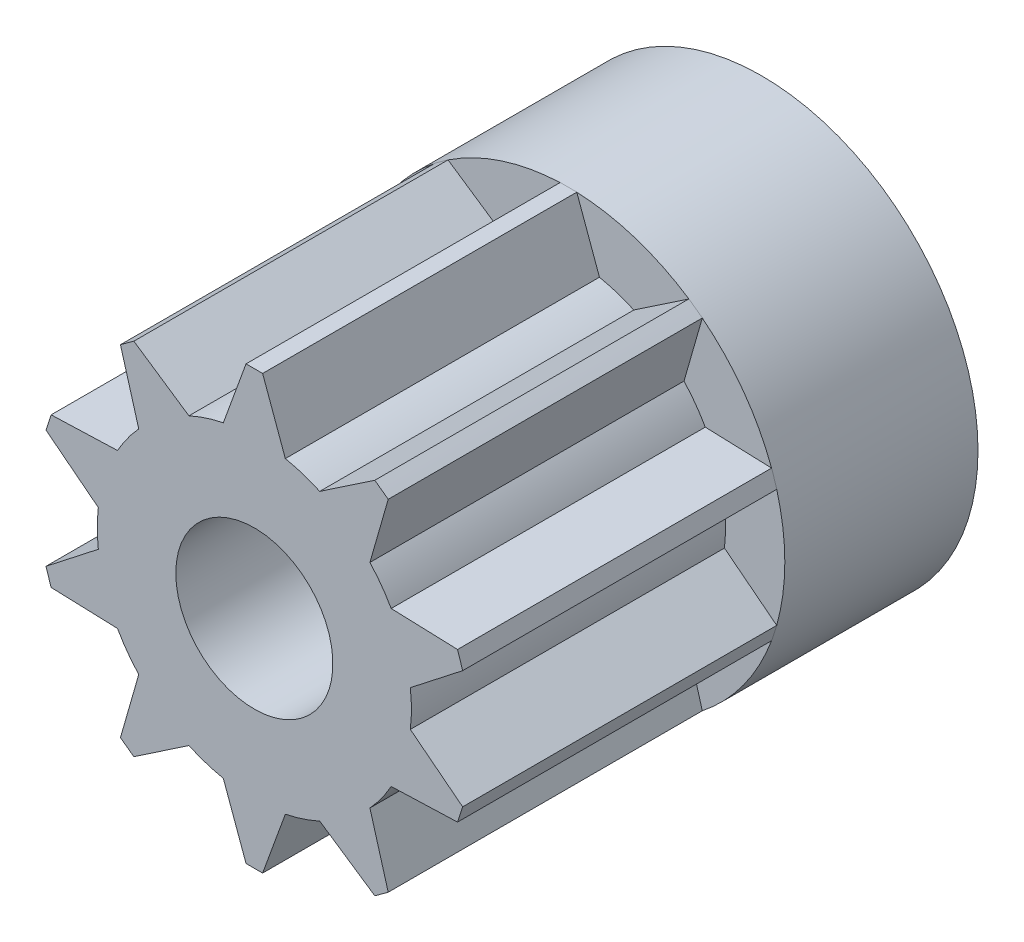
ISO-10303-21;
HEADER;
FILE_DESCRIPTION(('STEP AP214'),'2;1');
FILE_NAME('part.step','',(''),(''),'','','');
FILE_SCHEMA(('AUTOMOTIVE_DESIGN { 1 0 10303 214 1 1 1 1 }'));
ENDSEC;
DATA;
#1=APPLICATION_CONTEXT('core data for automotive mechanical design processes');
#2=APPLICATION_PROTOCOL_DEFINITION('international standard','automotive_design',2000,#1);
#3=PRODUCT_CONTEXT('',#1,'mechanical');
#4=PRODUCT('Part','Part','',(#3));
#5=PRODUCT_RELATED_PRODUCT_CATEGORY('part','',(#4));
#6=PRODUCT_DEFINITION_FORMATION('','',#4);
#7=PRODUCT_DEFINITION_CONTEXT('part definition',#1,'design');
#8=PRODUCT_DEFINITION('design','',#6,#7);
#9=PRODUCT_DEFINITION_SHAPE('','',#8);
#10=(LENGTH_UNIT() NAMED_UNIT(*) SI_UNIT(.MILLI.,.METRE.));
#11=(NAMED_UNIT(*) PLANE_ANGLE_UNIT() SI_UNIT($,.RADIAN.));
#12=(NAMED_UNIT(*) SI_UNIT($,.STERADIAN.) SOLID_ANGLE_UNIT());
#13=UNCERTAINTY_MEASURE_WITH_UNIT(LENGTH_MEASURE(1.E-05),#10,'distance_accuracy_value','');
#14=(GEOMETRIC_REPRESENTATION_CONTEXT(3) GLOBAL_UNCERTAINTY_ASSIGNED_CONTEXT((#13)) GLOBAL_UNIT_ASSIGNED_CONTEXT((#10,
#11,#12)) REPRESENTATION_CONTEXT('',''));
#15=CARTESIAN_POINT('',(0.,0.,0.));
#16=DIRECTION('',(0.,0.,1.));
#17=DIRECTION('',(1.,0.,0.));
#18=AXIS2_PLACEMENT_3D('',#15,#16,#17);
#19=CARTESIAN_POINT('',(14.2130911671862,-4.61811326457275,-4.));
#20=DIRECTION('',(0.,0.,-1.));
#21=DIRECTION('',(-1.,0.,0.));
#22=AXIS2_PLACEMENT_3D('',#19,#20,#21);
#23=CYLINDRICAL_SURFACE('',#22,17.7);
#24=CARTESIAN_POINT('',(14.2130911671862,-4.61811326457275,-4.));
#25=DIRECTION('',(0.,0.,1.));
#26=DIRECTION('',(-0.951056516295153,0.309016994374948,0.));
#27=AXIS2_PLACEMENT_3D('',#24,#25,#26);
#28=CIRCLE('',#27,17.7);
#29=CARTESIAN_POINT('',(-2.62060917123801,0.851487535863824,-4.));
#30=VERTEX_POINT('',#29);
#31=CARTESIAN_POINT('',(-2.65223186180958,0.750334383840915,-4.));
#32=VERTEX_POINT('',#31);
#33=EDGE_CURVE('E318',#30,#32,#28,.T.);
#34=ORIENTED_EDGE('',*,*,#33,.T.);
#35=DIRECTION('',(0.,0.,1.));
#36=VECTOR('',#35,1.);
#37=CARTESIAN_POINT('',(-2.6529595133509,0.750902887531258,-4.));
#38=LINE('',#37,#36);
#39=CARTESIAN_POINT('',(-2.6529595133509,0.750902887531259,0.));
#40=VERTEX_POINT('',#39);
#41=EDGE_CURVE('E316',#32,#40,#38,.T.);
#42=ORIENTED_EDGE('',*,*,#41,.T.);
#43=CARTESIAN_POINT('',(14.2130911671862,-4.61811326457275,0.));
#44=DIRECTION('',(0.,0.,-1.));
#45=DIRECTION('',(-0.952884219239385,0.303334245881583,0.));
#46=AXIS2_PLACEMENT_3D('',#43,#44,#45);
#47=CIRCLE('',#46,17.7);
#48=CARTESIAN_POINT('',(-2.58765897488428,0.951877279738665,0.));
#49=VERTEX_POINT('',#48);
#50=EDGE_CURVE('E299',#40,#49,#47,.T.);
#51=ORIENTED_EDGE('',*,*,#50,.T.);
#52=DIRECTION('',(0.,0.,1.));
#53=VECTOR('',#52,1.);
#54=CARTESIAN_POINT('',(-2.58765897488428,0.951877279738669,-4.));
#55=LINE('',#54,#53);
#56=CARTESIAN_POINT('',(-2.58673613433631,0.95190950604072,-4.));
#57=VERTEX_POINT('',#56);
#58=EDGE_CURVE('E329',#49,#57,#55,.F.);
#59=ORIENTED_EDGE('',*,*,#58,.T.);
#60=CARTESIAN_POINT('',(14.2130911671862,-4.61811326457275,-4.));
#61=DIRECTION('',(0.,0.,1.));
#62=DIRECTION('',(-0.949194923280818,0.314688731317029,0.));
#63=AXIS2_PLACEMENT_3D('',#60,#61,#62);
#64=CIRCLE('',#63,17.7);
#65=EDGE_CURVE('E312',#57,#30,#64,.T.);
#66=ORIENTED_EDGE('',*,*,#65,.T.);
#67=EDGE_LOOP('',(#34,#42,#51,#59,#66));
#68=FACE_BOUND('',#67,.T.);
#69=ADVANCED_FACE('F17',(#68),#23,.T.);
#70=CARTESIAN_POINT('',(-2.6529595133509,0.750902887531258,-4.));
#71=DIRECTION('',(0.615661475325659,0.788010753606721,0.));
#72=DIRECTION('',(-0.788010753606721,0.615661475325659,0.));
#73=AXIS2_PLACEMENT_3D('',#70,#71,#72);
#74=PLANE('',#73);
#75=ORIENTED_EDGE('',*,*,#41,.F.);
#76=DIRECTION('',(-0.788010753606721,0.615661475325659,0.));
#77=VECTOR('',#76,1.);
#78=CARTESIAN_POINT('',(-2.6529595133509,0.750902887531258,-4.));
#79=LINE('',#78,#77);
#80=CARTESIAN_POINT('',(-1.9866897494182,0.230355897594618,-4.));
#81=VERTEX_POINT('',#80);
#82=EDGE_CURVE('E323',#81,#32,#79,.T.);
#83=ORIENTED_EDGE('',*,*,#82,.F.);
#84=DIRECTION('',(0.,0.,-1.));
#85=VECTOR('',#84,1.);
#86=CARTESIAN_POINT('',(-1.98668974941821,0.230355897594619,-4.));
#87=LINE('',#86,#85);
#88=CARTESIAN_POINT('',(-1.9866897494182,0.230355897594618,0.));
#89=VERTEX_POINT('',#88);
#90=EDGE_CURVE('E327',#89,#81,#87,.T.);
#91=ORIENTED_EDGE('',*,*,#90,.F.);
#92=DIRECTION('',(-0.788010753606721,0.615661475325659,0.));
#93=VECTOR('',#92,1.);
#94=CARTESIAN_POINT('',(-2.6529595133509,0.750902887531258,0.));
#95=LINE('',#94,#93);
#96=EDGE_CURVE('E307',#40,#89,#95,.F.);
#97=ORIENTED_EDGE('',*,*,#96,.F.);
#98=EDGE_LOOP('',(#75,#83,#91,#97));
#99=FACE_BOUND('',#98,.T.);
#100=ADVANCED_FACE('F325',(#99),#74,.F.);
#101=CARTESIAN_POINT('',(-2.58765897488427,0.951877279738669,-4.));
#102=DIRECTION('',(0.0348994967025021,-0.999390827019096,0.));
#103=DIRECTION('',(0.999390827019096,0.0348994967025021,0.));
#104=AXIS2_PLACEMENT_3D('',#101,#102,#103);
#105=PLANE('',#104);
#106=DIRECTION('',(0.,0.,-1.));
#107=VECTOR('',#106,1.);
#108=CARTESIAN_POINT('',(-1.74266556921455,0.981385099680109,-4.));
#109=LINE('',#108,#107);
#110=CARTESIAN_POINT('',(-1.74266556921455,0.981385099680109,-4.));
#111=VERTEX_POINT('',#110);
#112=CARTESIAN_POINT('',(-1.74266556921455,0.981385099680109,0.));
#113=VERTEX_POINT('',#112);
#114=EDGE_CURVE('E377',#111,#113,#109,.F.);
#115=ORIENTED_EDGE('',*,*,#114,.F.);
#116=DIRECTION('',(0.999390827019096,0.0348994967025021,0.));
#117=VECTOR('',#116,1.);
#118=CARTESIAN_POINT('',(-2.58765897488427,0.951877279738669,-4.));
#119=LINE('',#118,#117);
#120=EDGE_CURVE('E331',#57,#111,#119,.T.);
#121=ORIENTED_EDGE('',*,*,#120,.F.);
#122=ORIENTED_EDGE('',*,*,#58,.F.);
#123=DIRECTION('',(0.999390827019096,0.0348994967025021,0.));
#124=VECTOR('',#123,1.);
#125=CARTESIAN_POINT('',(-2.58765897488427,0.951877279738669,0.));
#126=LINE('',#125,#124);
#127=EDGE_CURVE('E310',#113,#49,#126,.F.);
#128=ORIENTED_EDGE('',*,*,#127,.F.);
#129=EDGE_LOOP('',(#115,#121,#122,#128));
#130=FACE_BOUND('',#129,.T.);
#131=ADVANCED_FACE('F360',(#130),#105,.F.);
#132=CARTESIAN_POINT('',(0.,0.,-4.));
#133=DIRECTION('',(0.,0.,-1.));
#134=DIRECTION('',(-1.,0.,0.));
#135=AXIS2_PLACEMENT_3D('',#132,#133,#134);
#136=CYLINDRICAL_SURFACE('',#135,2.);
#137=CARTESIAN_POINT('',(0.,0.,0.));
#138=DIRECTION('',(0.,0.,-1.));
#139=DIRECTION('',(-0.993344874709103,-0.115177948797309,0.));
#140=AXIS2_PLACEMENT_3D('',#137,#138,#139);
#141=CIRCLE('',#140,2.);
#142=CARTESIAN_POINT('',(-1.9866897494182,-0.230355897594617,0.));
#143=VERTEX_POINT('',#142);
#144=EDGE_CURVE('E375',#143,#89,#141,.T.);
#145=ORIENTED_EDGE('',*,*,#144,.T.);
#146=ORIENTED_EDGE('',*,*,#90,.T.);
#147=CARTESIAN_POINT('',(0.,0.,-4.));
#148=DIRECTION('',(0.,0.,1.));
#149=DIRECTION('',(-0.993344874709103,0.115177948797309,0.));
#150=AXIS2_PLACEMENT_3D('',#147,#148,#149);
#151=CIRCLE('',#150,2.);
#152=CARTESIAN_POINT('',(-1.9866897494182,-0.230355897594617,-4.));
#153=VERTEX_POINT('',#152);
#154=EDGE_CURVE('E343',#81,#153,#151,.T.);
#155=ORIENTED_EDGE('',*,*,#154,.T.);
#156=DIRECTION('',(0.,0.,1.));
#157=VECTOR('',#156,1.);
#158=CARTESIAN_POINT('',(-1.9866897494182,-0.230355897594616,-4.));
#159=LINE('',#158,#157);
#160=EDGE_CURVE('E560',#153,#143,#159,.T.);
#161=ORIENTED_EDGE('',*,*,#160,.T.);
#162=EDGE_LOOP('',(#145,#146,#155,#161));
#163=FACE_BOUND('',#162,.T.);
#164=ADVANCED_FACE('F349',(#163),#136,.T.);
#165=CARTESIAN_POINT('',(0.,0.,-4.));
#166=DIRECTION('',(0.,0.,-1.));
#167=DIRECTION('',(-1.,0.,0.));
#168=AXIS2_PLACEMENT_3D('',#165,#166,#167);
#169=CYLINDRICAL_SURFACE('',#168,2.);
#170=CARTESIAN_POINT('',(0.,0.,0.));
#171=DIRECTION('',(0.,0.,-1.));
#172=DIRECTION('',(-0.871332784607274,0.490692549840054,0.));
#173=AXIS2_PLACEMENT_3D('',#170,#171,#172);
#174=CIRCLE('',#173,2.);
#175=CARTESIAN_POINT('',(-1.47186597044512,1.35410877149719,0.));
#176=VERTEX_POINT('',#175);
#177=EDGE_CURVE('E561',#113,#176,#174,.T.);
#178=ORIENTED_EDGE('',*,*,#177,.T.);
#179=DIRECTION('',(0.,0.,1.));
#180=VECTOR('',#179,1.);
#181=CARTESIAN_POINT('',(-1.47186597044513,1.35410877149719,-4.));
#182=LINE('',#181,#180);
#183=CARTESIAN_POINT('',(-1.47186597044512,1.35410877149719,-4.));
#184=VERTEX_POINT('',#183);
#185=EDGE_CURVE('E566',#176,#184,#182,.F.);
#186=ORIENTED_EDGE('',*,*,#185,.T.);
#187=CARTESIAN_POINT('',(0.,0.,-4.));
#188=DIRECTION('',(0.,0.,1.));
#189=DIRECTION('',(-0.735932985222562,0.677054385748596,0.));
#190=AXIS2_PLACEMENT_3D('',#187,#188,#189);
#191=CIRCLE('',#190,2.);
#192=EDGE_CURVE('E374',#184,#111,#191,.T.);
#193=ORIENTED_EDGE('',*,*,#192,.T.);
#194=ORIENTED_EDGE('',*,*,#114,.T.);
#195=EDGE_LOOP('',(#178,#186,#193,#194));
#196=FACE_BOUND('',#195,.T.);
#197=ADVANCED_FACE('F359',(#196),#169,.T.);
#198=CARTESIAN_POINT('',(-2.6529595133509,-0.750902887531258,-4.));
#199=DIRECTION('',(0.615661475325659,-0.788010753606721,0.));
#200=DIRECTION('',(0.788010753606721,0.615661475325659,0.));
#201=AXIS2_PLACEMENT_3D('',#198,#199,#200);
#202=PLANE('',#201);
#203=ORIENTED_EDGE('',*,*,#160,.F.);
#204=DIRECTION('',(0.788010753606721,0.615661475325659,0.));
#205=VECTOR('',#204,1.);
#206=CARTESIAN_POINT('',(-2.6529595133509,-0.750902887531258,-4.));
#207=LINE('',#206,#205);
#208=CARTESIAN_POINT('',(-2.65223186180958,-0.750334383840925,-4.));
#209=VERTEX_POINT('',#208);
#210=EDGE_CURVE('E553',#209,#153,#207,.T.);
#211=ORIENTED_EDGE('',*,*,#210,.F.);
#212=DIRECTION('',(0.,0.,-1.));
#213=VECTOR('',#212,1.);
#214=CARTESIAN_POINT('',(-2.6529595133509,-0.750902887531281,-4.));
#215=LINE('',#214,#213);
#216=CARTESIAN_POINT('',(-2.65295951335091,-0.750902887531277,0.));
#217=VERTEX_POINT('',#216);
#218=EDGE_CURVE('E605',#217,#209,#215,.T.);
#219=ORIENTED_EDGE('',*,*,#218,.F.);
#220=DIRECTION('',(0.788010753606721,0.615661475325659,0.));
#221=VECTOR('',#220,1.);
#222=CARTESIAN_POINT('',(-2.6529595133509,-0.750902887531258,0.));
#223=LINE('',#222,#221);
#224=EDGE_CURVE('E564',#143,#217,#223,.F.);
#225=ORIENTED_EDGE('',*,*,#224,.F.);
#226=EDGE_LOOP('',(#203,#211,#219,#225));
#227=FACE_BOUND('',#226,.T.);
#228=ADVANCED_FACE('F1552',(#227),#202,.F.);
#229=CARTESIAN_POINT('',(-1.70491968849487,2.16686367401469,-4.));
#230=DIRECTION('',(0.961261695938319,0.275637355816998,0.));
#231=DIRECTION('',(-0.275637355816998,0.961261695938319,0.));
#232=AXIS2_PLACEMENT_3D('',#229,#230,#231);
#233=PLANE('',#232);
#234=DIRECTION('',(0.,0.,-1.));
#235=VECTOR('',#234,1.);
#236=CARTESIAN_POINT('',(-1.70491968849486,2.16686367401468,-4.));
#237=LINE('',#236,#235);
#238=CARTESIAN_POINT('',(-1.704665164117,2.16597604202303,-4.));
#239=VERTEX_POINT('',#238);
#240=CARTESIAN_POINT('',(-1.70491968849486,2.16686367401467,0.));
#241=VERTEX_POINT('',#240);
#242=EDGE_CURVE('E648',#239,#241,#237,.F.);
#243=ORIENTED_EDGE('',*,*,#242,.F.);
#244=DIRECTION('',(-0.275637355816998,0.961261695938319,0.));
#245=VECTOR('',#244,1.);
#246=CARTESIAN_POINT('',(-1.70491968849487,2.16686367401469,-4.));
#247=LINE('',#246,#245);
#248=EDGE_CURVE('E617',#184,#239,#247,.T.);
#249=ORIENTED_EDGE('',*,*,#248,.F.);
#250=ORIENTED_EDGE('',*,*,#185,.F.);
#251=DIRECTION('',(-0.275637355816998,0.961261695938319,0.));
#252=VECTOR('',#251,1.);
#253=CARTESIAN_POINT('',(-1.70491968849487,2.16686367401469,0.));
#254=LINE('',#253,#252);
#255=EDGE_CURVE('E615',#241,#176,#254,.F.);
#256=ORIENTED_EDGE('',*,*,#255,.F.);
#257=EDGE_LOOP('',(#243,#249,#250,#256));
#258=FACE_BOUND('',#257,.T.);
#259=ADVANCED_FACE('F591',(#258),#233,.F.);
#260=CARTESIAN_POINT('',(14.2130911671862,4.61811326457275,-4.));
#261=DIRECTION('',(0.,0.,-1.));
#262=DIRECTION('',(-1.,0.,0.));
#263=AXIS2_PLACEMENT_3D('',#260,#261,#262);
#264=CYLINDRICAL_SURFACE('',#263,17.7);
#265=CARTESIAN_POINT('',(14.2130911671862,4.61811326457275,-4.));
#266=DIRECTION('',(0.,0.,1.));
#267=DIRECTION('',(-0.951056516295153,-0.309016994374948,0.));
#268=AXIS2_PLACEMENT_3D('',#265,#266,#267);
#269=CIRCLE('',#268,17.7);
#270=CARTESIAN_POINT('',(-2.62060917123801,-0.851487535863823,-4.));
#271=VERTEX_POINT('',#270);
#272=CARTESIAN_POINT('',(-2.5867361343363,-0.951909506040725,-4.));
#273=VERTEX_POINT('',#272);
#274=EDGE_CURVE('E614',#271,#273,#269,.T.);
#275=ORIENTED_EDGE('',*,*,#274,.T.);
#276=DIRECTION('',(0.,0.,1.));
#277=VECTOR('',#276,1.);
#278=CARTESIAN_POINT('',(-2.58765897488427,-0.951877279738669,-4.));
#279=LINE('',#278,#277);
#280=CARTESIAN_POINT('',(-2.58765897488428,-0.951877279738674,0.));
#281=VERTEX_POINT('',#280);
#282=EDGE_CURVE('E664',#273,#281,#279,.T.);
#283=ORIENTED_EDGE('',*,*,#282,.T.);
#284=CARTESIAN_POINT('',(14.2130911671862,4.61811326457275,0.));
#285=DIRECTION('',(0.,0.,-1.));
#286=DIRECTION('',(-0.949194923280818,-0.31468873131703,0.));
#287=AXIS2_PLACEMENT_3D('',#284,#285,#286);
#288=CIRCLE('',#287,17.7);
#289=EDGE_CURVE('E574',#281,#217,#288,.T.);
#290=ORIENTED_EDGE('',*,*,#289,.T.);
#291=ORIENTED_EDGE('',*,*,#218,.T.);
#292=CARTESIAN_POINT('',(14.2130911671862,4.61811326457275,-4.));
#293=DIRECTION('',(0.,0.,1.));
#294=DIRECTION('',(-0.952884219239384,-0.303334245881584,0.));
#295=AXIS2_PLACEMENT_3D('',#292,#293,#294);
#296=CIRCLE('',#295,17.7);
#297=EDGE_CURVE('E611',#209,#271,#296,.T.);
#298=ORIENTED_EDGE('',*,*,#297,.T.);
#299=EDGE_LOOP('',(#275,#283,#290,#291,#298));
#300=FACE_BOUND('',#299,.T.);
#301=ADVANCED_FACE('F580',(#300),#264,.T.);
#302=CARTESIAN_POINT('',(8.78417342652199,-12.0903774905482,-4.));
#303=DIRECTION('',(0.,0.,-1.));
#304=DIRECTION('',(-1.,0.,0.));
#305=AXIS2_PLACEMENT_3D('',#302,#303,#304);
#306=CYLINDRICAL_SURFACE('',#305,17.7);
#307=CARTESIAN_POINT('',(8.78417342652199,-12.0903774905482,-4.));
#308=DIRECTION('',(0.,0.,1.));
#309=DIRECTION('',(-0.587785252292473,0.809016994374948,0.));
#310=AXIS2_PLACEMENT_3D('',#307,#308,#309);
#311=CIRCLE('',#310,17.7);
#312=CARTESIAN_POINT('',(-1.61962553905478,2.22922330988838,-4.));
#313=VERTEX_POINT('',#312);
#314=EDGE_CURVE('E633',#313,#239,#311,.T.);
#315=ORIENTED_EDGE('',*,*,#314,.T.);
#316=ORIENTED_EDGE('',*,*,#242,.T.);
#317=CARTESIAN_POINT('',(8.78417342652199,-12.0903774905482,0.));
#318=DIRECTION('',(0.,0.,-1.));
#319=DIRECTION('',(-0.592604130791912,0.805493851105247,0.));
#320=AXIS2_PLACEMENT_3D('',#317,#318,#319);
#321=CIRCLE('',#320,17.7);
#322=CARTESIAN_POINT('',(-1.53396065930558,2.29107267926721,0.));
#323=VERTEX_POINT('',#322);
#324=EDGE_CURVE('E652',#241,#323,#321,.T.);
#325=ORIENTED_EDGE('',*,*,#324,.T.);
#326=DIRECTION('',(0.,0.,1.));
#327=VECTOR('',#326,1.);
#328=CARTESIAN_POINT('',(-1.53396065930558,2.29107267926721,-4.));
#329=LINE('',#328,#327);
#330=CARTESIAN_POINT('',(-1.53319512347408,2.29055631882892,-4.));
#331=VERTEX_POINT('',#330);
#332=EDGE_CURVE('E651',#323,#331,#329,.F.);
#333=ORIENTED_EDGE('',*,*,#332,.T.);
#334=CARTESIAN_POINT('',(8.78417342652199,-12.0903774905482,-4.));
#335=DIRECTION('',(0.,0.,1.));
#336=DIRECTION('',(-0.582945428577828,0.812511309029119,0.));
#337=AXIS2_PLACEMENT_3D('',#334,#335,#336);
#338=CIRCLE('',#337,17.7);
#339=EDGE_CURVE('E643',#331,#313,#338,.T.);
#340=ORIENTED_EDGE('',*,*,#339,.T.);
#341=EDGE_LOOP('',(#315,#316,#325,#333,#340));
#342=FACE_BOUND('',#341,.T.);
#343=ADVANCED_FACE('F590',(#342),#306,.T.);
#344=CARTESIAN_POINT('',(-2.58765897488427,-0.951877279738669,-4.));
#345=DIRECTION('',(0.0348994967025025,0.999390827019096,0.));
#346=DIRECTION('',(-0.999390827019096,0.0348994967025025,0.));
#347=AXIS2_PLACEMENT_3D('',#344,#345,#346);
#348=PLANE('',#347);
#349=ORIENTED_EDGE('',*,*,#282,.F.);
#350=DIRECTION('',(-0.999390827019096,0.0348994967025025,0.));
#351=VECTOR('',#350,1.);
#352=CARTESIAN_POINT('',(-2.58765897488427,-0.951877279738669,-4.));
#353=LINE('',#352,#351);
#354=CARTESIAN_POINT('',(-1.74266556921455,-0.981385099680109,-4.));
#355=VERTEX_POINT('',#354);
#356=EDGE_CURVE('E671',#355,#273,#353,.T.);
#357=ORIENTED_EDGE('',*,*,#356,.F.);
#358=DIRECTION('',(0.,0.,-1.));
#359=VECTOR('',#358,1.);
#360=CARTESIAN_POINT('',(-1.74266556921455,-0.981385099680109,-4.));
#361=LINE('',#360,#359);
#362=CARTESIAN_POINT('',(-1.74266556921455,-0.981385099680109,0.));
#363=VERTEX_POINT('',#362);
#364=EDGE_CURVE('E2134',#363,#355,#361,.T.);
#365=ORIENTED_EDGE('',*,*,#364,.F.);
#366=DIRECTION('',(-0.999390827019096,0.0348994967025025,0.));
#367=VECTOR('',#366,1.);
#368=CARTESIAN_POINT('',(-2.58765897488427,-0.951877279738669,0.));
#369=LINE('',#368,#367);
#370=EDGE_CURVE('E2147',#281,#363,#369,.F.);
#371=ORIENTED_EDGE('',*,*,#370,.F.);
#372=EDGE_LOOP('',(#349,#357,#365,#371));
#373=FACE_BOUND('',#372,.T.);
#374=ADVANCED_FACE('F1530',(#373),#348,.F.);
#375=CARTESIAN_POINT('',(-1.53396065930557,2.29107267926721,-4.));
#376=DIRECTION('',(-0.559192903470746,-0.829037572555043,0.));
#377=DIRECTION('',(0.829037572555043,-0.559192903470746,0.));
#378=AXIS2_PLACEMENT_3D('',#375,#376,#377);
#379=PLANE('',#378);
#380=DIRECTION('',(0.,0.,-1.));
#381=VECTOR('',#380,1.);
#382=CARTESIAN_POINT('',(-0.833002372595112,1.81827034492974,-4.));
#383=LINE('',#382,#381);
#384=CARTESIAN_POINT('',(-0.833002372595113,1.81827034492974,-4.));
#385=VERTEX_POINT('',#384);
#386=CARTESIAN_POINT('',(-0.833002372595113,1.81827034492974,0.));
#387=VERTEX_POINT('',#386);
#388=EDGE_CURVE('E2128',#385,#387,#383,.F.);
#389=ORIENTED_EDGE('',*,*,#388,.F.);
#390=DIRECTION('',(0.829037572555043,-0.559192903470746,0.));
#391=VECTOR('',#390,1.);
#392=CARTESIAN_POINT('',(-1.53396065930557,2.29107267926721,-4.));
#393=LINE('',#392,#391);
#394=EDGE_CURVE('E2141',#331,#385,#393,.T.);
#395=ORIENTED_EDGE('',*,*,#394,.F.);
#396=ORIENTED_EDGE('',*,*,#332,.F.);
#397=DIRECTION('',(0.829037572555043,-0.559192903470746,0.));
#398=VECTOR('',#397,1.);
#399=CARTESIAN_POINT('',(-1.53396065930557,2.29107267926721,0.));
#400=LINE('',#399,#398);
#401=EDGE_CURVE('E2143',#387,#323,#400,.F.);
#402=ORIENTED_EDGE('',*,*,#401,.F.);
#403=EDGE_LOOP('',(#389,#395,#396,#402));
#404=FACE_BOUND('',#403,.T.);
#405=ADVANCED_FACE('F1522',(#404),#379,.F.);
#406=CARTESIAN_POINT('',(0.,0.,-4.));
#407=DIRECTION('',(0.,0.,-1.));
#408=DIRECTION('',(-1.,0.,0.));
#409=AXIS2_PLACEMENT_3D('',#406,#407,#408);
#410=CYLINDRICAL_SURFACE('',#409,2.);
#411=CARTESIAN_POINT('',(0.,0.,0.));
#412=DIRECTION('',(0.,0.,-1.));
#413=DIRECTION('',(-0.735932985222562,-0.677054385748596,0.));
#414=AXIS2_PLACEMENT_3D('',#411,#412,#413);
#415=CIRCLE('',#414,2.);
#416=CARTESIAN_POINT('',(-1.47186597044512,-1.35410877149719,0.));
#417=VERTEX_POINT('',#416);
#418=EDGE_CURVE('E2189',#417,#363,#415,.T.);
#419=ORIENTED_EDGE('',*,*,#418,.T.);
#420=ORIENTED_EDGE('',*,*,#364,.T.);
#421=CARTESIAN_POINT('',(0.,0.,-4.));
#422=DIRECTION('',(0.,0.,1.));
#423=DIRECTION('',(-0.871332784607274,-0.490692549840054,0.));
#424=AXIS2_PLACEMENT_3D('',#421,#422,#423);
#425=CIRCLE('',#424,2.);
#426=CARTESIAN_POINT('',(-1.47186597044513,-1.35410877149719,-4.));
#427=VERTEX_POINT('',#426);
#428=EDGE_CURVE('E676',#355,#427,#425,.T.);
#429=ORIENTED_EDGE('',*,*,#428,.T.);
#430=DIRECTION('',(0.,0.,1.));
#431=VECTOR('',#430,1.);
#432=CARTESIAN_POINT('',(-1.47186597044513,-1.35410877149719,-4.));
#433=LINE('',#432,#431);
#434=EDGE_CURVE('E2122',#427,#417,#433,.T.);
#435=ORIENTED_EDGE('',*,*,#434,.T.);
#436=EDGE_LOOP('',(#419,#420,#429,#435));
#437=FACE_BOUND('',#436,.T.);
#438=ADVANCED_FACE('F1514',(#437),#410,.T.);
#439=CARTESIAN_POINT('',(0.,0.,-4.));
#440=DIRECTION('',(0.,0.,-1.));
#441=DIRECTION('',(-1.,0.,0.));
#442=AXIS2_PLACEMENT_3D('',#439,#440,#441);
#443=CYLINDRICAL_SURFACE('',#442,2.);
#444=CARTESIAN_POINT('',(0.,0.,0.));
#445=DIRECTION('',(0.,0.,-1.));
#446=DIRECTION('',(-0.416501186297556,0.90913517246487,0.));
#447=AXIS2_PLACEMENT_3D('',#444,#445,#446);
#448=CIRCLE('',#447,2.);
#449=CARTESIAN_POINT('',(-0.394839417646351,1.96063811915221,0.));
#450=VERTEX_POINT('',#449);
#451=EDGE_CURVE('E2125',#387,#450,#448,.T.);
#452=ORIENTED_EDGE('',*,*,#451,.T.);
#453=DIRECTION('',(0.,0.,1.));
#454=VECTOR('',#453,1.);
#455=CARTESIAN_POINT('',(-0.394839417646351,1.96063811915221,-4.));
#456=LINE('',#455,#454);
#457=CARTESIAN_POINT('',(-0.394839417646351,1.96063811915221,-4.));
#458=VERTEX_POINT('',#457);
#459=EDGE_CURVE('E1342',#450,#458,#456,.F.);
#460=ORIENTED_EDGE('',*,*,#459,.T.);
#461=CARTESIAN_POINT('',(0.,0.,-4.));
#462=DIRECTION('',(0.,0.,1.));
#463=DIRECTION('',(-0.197419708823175,0.980319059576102,0.));
#464=AXIS2_PLACEMENT_3D('',#461,#462,#463);
#465=CIRCLE('',#464,2.);
#466=EDGE_CURVE('E1887',#458,#385,#465,.T.);
#467=ORIENTED_EDGE('',*,*,#466,.T.);
#468=ORIENTED_EDGE('',*,*,#388,.T.);
#469=EDGE_LOOP('',(#452,#460,#467,#468));
#470=FACE_BOUND('',#469,.T.);
#471=ADVANCED_FACE('F1506',(#470),#443,.T.);
#472=CARTESIAN_POINT('',(-1.70491968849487,-2.16686367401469,-4.));
#473=DIRECTION('',(0.961261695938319,-0.275637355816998,0.));
#474=DIRECTION('',(0.275637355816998,0.961261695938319,0.));
#475=AXIS2_PLACEMENT_3D('',#472,#473,#474);
#476=PLANE('',#475);
#477=ORIENTED_EDGE('',*,*,#434,.F.);
#478=DIRECTION('',(0.275637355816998,0.961261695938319,0.));
#479=VECTOR('',#478,1.);
#480=CARTESIAN_POINT('',(-1.70491968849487,-2.16686367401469,-4.));
#481=LINE('',#480,#479);
#482=CARTESIAN_POINT('',(-1.704665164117,-2.16597604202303,-4.));
#483=VERTEX_POINT('',#482);
#484=EDGE_CURVE('E2124',#483,#427,#481,.T.);
#485=ORIENTED_EDGE('',*,*,#484,.F.);
#486=DIRECTION('',(0.,0.,-1.));
#487=VECTOR('',#486,1.);
#488=CARTESIAN_POINT('',(-1.70491968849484,-2.16686367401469,-4.));
#489=LINE('',#488,#487);
#490=CARTESIAN_POINT('',(-1.70491968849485,-2.16686367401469,0.));
#491=VERTEX_POINT('',#490);
#492=EDGE_CURVE('E2095',#491,#483,#489,.T.);
#493=ORIENTED_EDGE('',*,*,#492,.F.);
#494=DIRECTION('',(0.275637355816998,0.961261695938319,0.));
#495=VECTOR('',#494,1.);
#496=CARTESIAN_POINT('',(-1.70491968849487,-2.16686367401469,0.));
#497=LINE('',#496,#495);
#498=EDGE_CURVE('E2120',#417,#491,#497,.F.);
#499=ORIENTED_EDGE('',*,*,#498,.F.);
#500=EDGE_LOOP('',(#477,#485,#493,#499));
#501=FACE_BOUND('',#500,.T.);
#502=ADVANCED_FACE('F1499',(#501),#476,.F.);
#503=CARTESIAN_POINT('',(-0.105658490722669,2.75515618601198,-4.));
#504=DIRECTION('',(0.939692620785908,-0.34202014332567,0.));
#505=DIRECTION('',(0.34202014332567,0.939692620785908,0.));
#506=AXIS2_PLACEMENT_3D('',#503,#504,#505);
#507=PLANE('',#506);
#508=DIRECTION('',(0.,0.,-1.));
#509=VECTOR('',#508,1.);
#510=CARTESIAN_POINT('',(-0.105658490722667,2.75515618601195,-4.));
#511=LINE('',#510,#509);
#512=CARTESIAN_POINT('',(-0.105974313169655,2.75428847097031,-4.));
#513=VERTEX_POINT('',#512);
#514=CARTESIAN_POINT('',(-0.10565849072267,2.75515618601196,0.));
#515=VERTEX_POINT('',#514);
#516=EDGE_CURVE('E1288',#513,#515,#511,.F.);
#517=ORIENTED_EDGE('',*,*,#516,.F.);
#518=DIRECTION('',(0.34202014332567,0.939692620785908,0.));
#519=VECTOR('',#518,1.);
#520=CARTESIAN_POINT('',(-0.105658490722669,2.75515618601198,-4.));
#521=LINE('',#520,#519);
#522=EDGE_CURVE('E1334',#458,#513,#521,.T.);
#523=ORIENTED_EDGE('',*,*,#522,.F.);
#524=ORIENTED_EDGE('',*,*,#459,.F.);
#525=DIRECTION('',(0.34202014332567,0.939692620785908,0.));
#526=VECTOR('',#525,1.);
#527=CARTESIAN_POINT('',(-0.105658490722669,2.75515618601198,0.));
#528=LINE('',#527,#526);
#529=EDGE_CURVE('E1341',#515,#450,#528,.F.);
#530=ORIENTED_EDGE('',*,*,#529,.F.);
#531=EDGE_LOOP('',(#517,#523,#524,#530));
#532=FACE_BOUND('',#531,.T.);
#533=ADVANCED_FACE('F1492',(#532),#507,.F.);
#534=CARTESIAN_POINT('',(8.78417342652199,12.0903774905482,-4.));
#535=DIRECTION('',(0.,0.,-1.));
#536=DIRECTION('',(-1.,0.,0.));
#537=AXIS2_PLACEMENT_3D('',#534,#535,#536);
#538=CYLINDRICAL_SURFACE('',#537,17.7);
#539=CARTESIAN_POINT('',(8.78417342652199,12.0903774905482,-4.));
#540=DIRECTION('',(0.,0.,1.));
#541=DIRECTION('',(-0.587785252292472,-0.809016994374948,0.));
#542=AXIS2_PLACEMENT_3D('',#539,#540,#541);
#543=CIRCLE('',#542,17.7);
#544=CARTESIAN_POINT('',(-1.61962553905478,-2.22922330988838,-4.));
#545=VERTEX_POINT('',#544);
#546=CARTESIAN_POINT('',(-1.53319512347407,-2.29055631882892,-4.));
#547=VERTEX_POINT('',#546);
#548=EDGE_CURVE('E2086',#545,#547,#543,.T.);
#549=ORIENTED_EDGE('',*,*,#548,.T.);
#550=DIRECTION('',(0.,0.,1.));
#551=VECTOR('',#550,1.);
#552=CARTESIAN_POINT('',(-1.53396065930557,-2.29107267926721,-4.));
#553=LINE('',#552,#551);
#554=CARTESIAN_POINT('',(-1.53396065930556,-2.29107267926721,0.));
#555=VERTEX_POINT('',#554);
#556=EDGE_CURVE('E1287',#547,#555,#553,.T.);
#557=ORIENTED_EDGE('',*,*,#556,.T.);
#558=CARTESIAN_POINT('',(8.78417342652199,12.0903774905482,0.));
#559=DIRECTION('',(0.,0.,-1.));
#560=DIRECTION('',(-0.582945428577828,-0.812511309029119,0.));
#561=AXIS2_PLACEMENT_3D('',#558,#559,#560);
#562=CIRCLE('',#561,17.7);
#563=EDGE_CURVE('E1349',#555,#491,#562,.T.);
#564=ORIENTED_EDGE('',*,*,#563,.T.);
#565=ORIENTED_EDGE('',*,*,#492,.T.);
#566=CARTESIAN_POINT('',(8.78417342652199,12.0903774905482,-4.));
#567=DIRECTION('',(0.,0.,1.));
#568=DIRECTION('',(-0.592604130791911,-0.805493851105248,0.));
#569=AXIS2_PLACEMENT_3D('',#566,#567,#568);
#570=CIRCLE('',#569,17.7);
#571=EDGE_CURVE('E684',#483,#545,#570,.T.);
#572=ORIENTED_EDGE('',*,*,#571,.T.);
#573=EDGE_LOOP('',(#549,#557,#564,#565,#572));
#574=FACE_BOUND('',#573,.T.);
#575=ADVANCED_FACE('F1369',(#574),#538,.T.);
#576=CARTESIAN_POINT('',(0.,-14.9445284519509,-4.));
#577=DIRECTION('',(0.,0.,-1.));
#578=DIRECTION('',(-1.,0.,0.));
#579=AXIS2_PLACEMENT_3D('',#576,#577,#578);
#580=CYLINDRICAL_SURFACE('',#579,17.7);
#581=CARTESIAN_POINT('',(0.,-14.9445284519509,-4.));
#582=DIRECTION('',(0.,0.,1.));
#583=DIRECTION('',(0.,1.,0.));
#584=AXIS2_PLACEMENT_3D('',#581,#582,#583);
#585=CIRCLE('',#584,17.7);
#586=CARTESIAN_POINT('',(0.,2.75547154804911,-4.));
#587=VERTEX_POINT('',#586);
#588=EDGE_CURVE('E1294',#587,#513,#585,.T.);
#589=ORIENTED_EDGE('',*,*,#588,.T.);
#590=ORIENTED_EDGE('',*,*,#516,.T.);
#591=CARTESIAN_POINT('',(0.,-14.9445284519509,0.));
#592=DIRECTION('',(0.,0.,-1.));
#593=DIRECTION('',(-0.00596940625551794,0.999982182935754,0.));
#594=AXIS2_PLACEMENT_3D('',#591,#592,#593);
#595=CIRCLE('',#594,17.7);
#596=CARTESIAN_POINT('',(0.105658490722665,2.75515618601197,0.));
#597=VERTEX_POINT('',#596);
#598=EDGE_CURVE('E1388',#515,#597,#595,.T.);
#599=ORIENTED_EDGE('',*,*,#598,.T.);
#600=DIRECTION('',(0.,0.,1.));
#601=VECTOR('',#600,1.);
#602=CARTESIAN_POINT('',(0.105658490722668,2.75515618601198,-4.));
#603=LINE('',#602,#601);
#604=CARTESIAN_POINT('',(0.105974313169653,2.75428847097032,-4.));
#605=VERTEX_POINT('',#604);
#606=EDGE_CURVE('E1393',#597,#605,#603,.F.);
#607=ORIENTED_EDGE('',*,*,#606,.T.);
#608=CARTESIAN_POINT('',(0.,-14.9445284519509,-4.));
#609=DIRECTION('',(0.,0.,1.));
#610=DIRECTION('',(0.00596940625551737,0.999982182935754,0.));
#611=AXIS2_PLACEMENT_3D('',#608,#609,#610);
#612=CIRCLE('',#611,17.7);
#613=EDGE_CURVE('E1383',#605,#587,#612,.T.);
#614=ORIENTED_EDGE('',*,*,#613,.T.);
#615=EDGE_LOOP('',(#589,#590,#599,#607,#614));
#616=FACE_BOUND('',#615,.T.);
#617=ADVANCED_FACE('F1359',(#616),#580,.T.);
#618=CARTESIAN_POINT('',(-1.53396065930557,-2.29107267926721,-4.));
#619=DIRECTION('',(-0.559192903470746,0.829037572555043,0.));
#620=DIRECTION('',(-0.829037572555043,-0.559192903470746,0.));
#621=AXIS2_PLACEMENT_3D('',#618,#619,#620);
#622=PLANE('',#621);
#623=ORIENTED_EDGE('',*,*,#556,.F.);
#624=DIRECTION('',(-0.829037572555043,-0.559192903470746,0.));
#625=VECTOR('',#624,1.);
#626=CARTESIAN_POINT('',(-1.53396065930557,-2.29107267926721,-4.));
#627=LINE('',#626,#625);
#628=CARTESIAN_POINT('',(-0.833002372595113,-1.81827034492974,-4.));
#629=VERTEX_POINT('',#628);
#630=EDGE_CURVE('E1281',#629,#547,#627,.T.);
#631=ORIENTED_EDGE('',*,*,#630,.F.);
#632=DIRECTION('',(0.,0.,-1.));
#633=VECTOR('',#632,1.);
#634=CARTESIAN_POINT('',(-0.833002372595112,-1.81827034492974,-4.));
#635=LINE('',#634,#633);
#636=CARTESIAN_POINT('',(-0.833002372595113,-1.81827034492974,0.));
#637=VERTEX_POINT('',#636);
#638=EDGE_CURVE('E1310',#637,#629,#635,.T.);
#639=ORIENTED_EDGE('',*,*,#638,.F.);
#640=DIRECTION('',(-0.829037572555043,-0.559192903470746,0.));
#641=VECTOR('',#640,1.);
#642=CARTESIAN_POINT('',(-1.53396065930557,-2.29107267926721,0.));
#643=LINE('',#642,#641);
#644=EDGE_CURVE('E1291',#555,#637,#643,.F.);
#645=ORIENTED_EDGE('',*,*,#644,.F.);
#646=EDGE_LOOP('',(#623,#631,#639,#645));
#647=FACE_BOUND('',#646,.T.);
#648=ADVANCED_FACE('F1368',(#647),#622,.F.);
#649=CARTESIAN_POINT('',(0.105658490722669,2.75515618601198,-4.));
#650=DIRECTION('',(-0.939692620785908,-0.34202014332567,0.));
#651=DIRECTION('',(0.34202014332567,-0.939692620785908,0.));
#652=AXIS2_PLACEMENT_3D('',#649,#650,#651);
#653=PLANE('',#652);
#654=DIRECTION('',(0.,0.,-1.));
#655=VECTOR('',#654,1.);
#656=CARTESIAN_POINT('',(0.39483941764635,1.9606381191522,-4.));
#657=LINE('',#656,#655);
#658=CARTESIAN_POINT('',(0.39483941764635,1.96063811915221,-4.));
#659=VERTEX_POINT('',#658);
#660=CARTESIAN_POINT('',(0.39483941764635,1.96063811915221,0.));
#661=VERTEX_POINT('',#660);
#662=EDGE_CURVE('E1395',#659,#661,#657,.F.);
#663=ORIENTED_EDGE('',*,*,#662,.F.);
#664=DIRECTION('',(0.34202014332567,-0.939692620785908,0.));
#665=VECTOR('',#664,1.);
#666=CARTESIAN_POINT('',(0.105658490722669,2.75515618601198,-4.));
#667=LINE('',#666,#665);
#668=EDGE_CURVE('E1392',#605,#659,#667,.T.);
#669=ORIENTED_EDGE('',*,*,#668,.F.);
#670=ORIENTED_EDGE('',*,*,#606,.F.);
#671=DIRECTION('',(0.34202014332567,-0.939692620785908,0.));
#672=VECTOR('',#671,1.);
#673=CARTESIAN_POINT('',(0.105658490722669,2.75515618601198,0.));
#674=LINE('',#673,#672);
#675=EDGE_CURVE('E1398',#661,#597,#674,.F.);
#676=ORIENTED_EDGE('',*,*,#675,.F.);
#677=EDGE_LOOP('',(#663,#669,#670,#676));
#678=FACE_BOUND('',#677,.T.);
#679=ADVANCED_FACE('F1323',(#678),#653,.F.);
#680=CARTESIAN_POINT('',(0.,0.,-4.));
#681=DIRECTION('',(0.,0.,-1.));
#682=DIRECTION('',(-1.,0.,0.));
#683=AXIS2_PLACEMENT_3D('',#680,#681,#682);
#684=CYLINDRICAL_SURFACE('',#683,2.);
#685=CARTESIAN_POINT('',(0.,0.,0.));
#686=DIRECTION('',(0.,0.,-1.));
#687=DIRECTION('',(-0.197419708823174,-0.980319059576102,0.));
#688=AXIS2_PLACEMENT_3D('',#685,#686,#687);
#689=CIRCLE('',#688,2.);
#690=CARTESIAN_POINT('',(-0.394839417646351,-1.96063811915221,0.));
#691=VERTEX_POINT('',#690);
#692=EDGE_CURVE('E1305',#691,#637,#689,.T.);
#693=ORIENTED_EDGE('',*,*,#692,.T.);
#694=ORIENTED_EDGE('',*,*,#638,.T.);
#695=CARTESIAN_POINT('',(0.,0.,-4.));
#696=DIRECTION('',(0.,0.,1.));
#697=DIRECTION('',(-0.416501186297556,-0.90913517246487,0.));
#698=AXIS2_PLACEMENT_3D('',#695,#696,#697);
#699=CIRCLE('',#698,2.);
#700=CARTESIAN_POINT('',(-0.394839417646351,-1.96063811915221,-4.));
#701=VERTEX_POINT('',#700);
#702=EDGE_CURVE('E1282',#629,#701,#699,.T.);
#703=ORIENTED_EDGE('',*,*,#702,.T.);
#704=DIRECTION('',(0.,0.,1.));
#705=VECTOR('',#704,1.);
#706=CARTESIAN_POINT('',(-0.394839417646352,-1.96063811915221,-4.));
#707=LINE('',#706,#705);
#708=EDGE_CURVE('E1428',#701,#691,#707,.T.);
#709=ORIENTED_EDGE('',*,*,#708,.T.);
#710=EDGE_LOOP('',(#693,#694,#703,#709));
#711=FACE_BOUND('',#710,.T.);
#712=ADVANCED_FACE('F1312',(#711),#684,.T.);
#713=CARTESIAN_POINT('',(0.,0.,-4.));
#714=DIRECTION('',(0.,0.,-1.));
#715=DIRECTION('',(-1.,0.,0.));
#716=AXIS2_PLACEMENT_3D('',#713,#714,#715);
#717=CYLINDRICAL_SURFACE('',#716,2.);
#718=CARTESIAN_POINT('',(0.,0.,0.));
#719=DIRECTION('',(0.,0.,-1.));
#720=DIRECTION('',(0.197419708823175,0.980319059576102,0.));
#721=AXIS2_PLACEMENT_3D('',#718,#719,#720);
#722=CIRCLE('',#721,2.);
#723=CARTESIAN_POINT('',(0.833002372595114,1.81827034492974,0.));
#724=VERTEX_POINT('',#723);
#725=EDGE_CURVE('E1425',#661,#724,#722,.T.);
#726=ORIENTED_EDGE('',*,*,#725,.T.);
#727=DIRECTION('',(0.,0.,1.));
#728=VECTOR('',#727,1.);
#729=CARTESIAN_POINT('',(0.833002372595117,1.81827034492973,-4.));
#730=LINE('',#729,#728);
#731=CARTESIAN_POINT('',(0.833002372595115,1.81827034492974,-4.));
#732=VERTEX_POINT('',#731);
#733=EDGE_CURVE('E1210',#724,#732,#730,.F.);
#734=ORIENTED_EDGE('',*,*,#733,.T.);
#735=CARTESIAN_POINT('',(0.,0.,-4.));
#736=DIRECTION('',(0.,0.,1.));
#737=DIRECTION('',(0.416501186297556,0.90913517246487,0.));
#738=AXIS2_PLACEMENT_3D('',#735,#736,#737);
#739=CIRCLE('',#738,2.);
#740=EDGE_CURVE('E1415',#732,#659,#739,.T.);
#741=ORIENTED_EDGE('',*,*,#740,.T.);
#742=ORIENTED_EDGE('',*,*,#662,.T.);
#743=EDGE_LOOP('',(#726,#734,#741,#742));
#744=FACE_BOUND('',#743,.T.);
#745=ADVANCED_FACE('F1322',(#744),#717,.T.);
#746=CARTESIAN_POINT('',(-0.10565849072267,-2.75515618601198,-4.));
#747=DIRECTION('',(0.939692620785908,0.34202014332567,0.));
#748=DIRECTION('',(-0.34202014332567,0.939692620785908,0.));
#749=AXIS2_PLACEMENT_3D('',#746,#747,#748);
#750=PLANE('',#749);
#751=ORIENTED_EDGE('',*,*,#708,.F.);
#752=DIRECTION('',(-0.34202014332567,0.939692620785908,0.));
#753=VECTOR('',#752,1.);
#754=CARTESIAN_POINT('',(-0.10565849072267,-2.75515618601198,-4.));
#755=LINE('',#754,#753);
#756=CARTESIAN_POINT('',(-0.10597431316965,-2.75428847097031,-4.));
#757=VERTEX_POINT('',#756);
#758=EDGE_CURVE('E1278',#757,#701,#755,.T.);
#759=ORIENTED_EDGE('',*,*,#758,.F.);
#760=DIRECTION('',(0.,0.,-1.));
#761=VECTOR('',#760,1.);
#762=CARTESIAN_POINT('',(-0.105658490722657,-2.75515618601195,-4.));
#763=LINE('',#762,#761);
#764=CARTESIAN_POINT('',(-0.105658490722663,-2.75515618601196,0.));
#765=VERTEX_POINT('',#764);
#766=EDGE_CURVE('E1263',#765,#757,#763,.T.);
#767=ORIENTED_EDGE('',*,*,#766,.F.);
#768=DIRECTION('',(-0.34202014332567,0.939692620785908,0.));
#769=VECTOR('',#768,1.);
#770=CARTESIAN_POINT('',(-0.10565849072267,-2.75515618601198,0.));
#771=LINE('',#770,#769);
#772=EDGE_CURVE('E1432',#691,#765,#771,.F.);
#773=ORIENTED_EDGE('',*,*,#772,.F.);
#774=EDGE_LOOP('',(#751,#759,#767,#773));
#775=FACE_BOUND('',#774,.T.);
#776=ADVANCED_FACE('F1431',(#775),#750,.F.);
#777=CARTESIAN_POINT('',(1.53396065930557,2.29107267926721,-4.));
#778=DIRECTION('',(0.559192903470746,-0.829037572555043,0.));
#779=DIRECTION('',(0.829037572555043,0.559192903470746,0.));
#780=AXIS2_PLACEMENT_3D('',#777,#778,#779);
#781=PLANE('',#780);
#782=DIRECTION('',(0.,0.,-1.));
#783=VECTOR('',#782,1.);
#784=CARTESIAN_POINT('',(1.53396065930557,2.2910726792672,-4.));
#785=LINE('',#784,#783);
#786=CARTESIAN_POINT('',(1.53319512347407,2.29055631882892,-4.));
#787=VERTEX_POINT('',#786);
#788=CARTESIAN_POINT('',(1.53396065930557,2.29107267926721,0.));
#789=VERTEX_POINT('',#788);
#790=EDGE_CURVE('E1213',#787,#789,#785,.F.);
#791=ORIENTED_EDGE('',*,*,#790,.F.);
#792=DIRECTION('',(0.829037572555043,0.559192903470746,0.));
#793=VECTOR('',#792,1.);
#794=CARTESIAN_POINT('',(1.53396065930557,2.29107267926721,-4.));
#795=LINE('',#794,#793);
#796=EDGE_CURVE('E1202',#732,#787,#795,.T.);
#797=ORIENTED_EDGE('',*,*,#796,.F.);
#798=ORIENTED_EDGE('',*,*,#733,.F.);
#799=DIRECTION('',(0.829037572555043,0.559192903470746,0.));
#800=VECTOR('',#799,1.);
#801=CARTESIAN_POINT('',(1.53396065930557,2.29107267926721,0.));
#802=LINE('',#801,#800);
#803=EDGE_CURVE('E1209',#789,#724,#802,.F.);
#804=ORIENTED_EDGE('',*,*,#803,.F.);
#805=EDGE_LOOP('',(#791,#797,#798,#804));
#806=FACE_BOUND('',#805,.T.);
#807=ADVANCED_FACE('F1453',(#806),#781,.F.);
#808=CARTESIAN_POINT('',(0.,14.9445284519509,-4.));
#809=DIRECTION('',(0.,0.,-1.));
#810=DIRECTION('',(-1.,0.,0.));
#811=AXIS2_PLACEMENT_3D('',#808,#809,#810);
#812=CYLINDRICAL_SURFACE('',#811,17.7);
#813=CARTESIAN_POINT('',(0.,14.9445284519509,-4.));
#814=DIRECTION('',(0.,0.,1.));
#815=DIRECTION('',(0.,-1.,0.));
#816=AXIS2_PLACEMENT_3D('',#813,#814,#815);
#817=CIRCLE('',#816,17.7);
#818=CARTESIAN_POINT('',(0.,-2.75547154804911,-4.));
#819=VERTEX_POINT('',#818);
#820=CARTESIAN_POINT('',(0.105974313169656,-2.75428847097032,-4.));
#821=VERTEX_POINT('',#820);
#822=EDGE_CURVE('E1256',#819,#821,#817,.T.);
#823=ORIENTED_EDGE('',*,*,#822,.T.);
#824=DIRECTION('',(0.,0.,1.));
#825=VECTOR('',#824,1.);
#826=CARTESIAN_POINT('',(0.105658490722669,-2.75515618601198,-4.));
#827=LINE('',#826,#825);
#828=CARTESIAN_POINT('',(0.105658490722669,-2.75515618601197,0.));
#829=VERTEX_POINT('',#828);
#830=EDGE_CURVE('E1169',#821,#829,#827,.T.);
#831=ORIENTED_EDGE('',*,*,#830,.T.);
#832=CARTESIAN_POINT('',(0.,14.9445284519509,0.));
#833=DIRECTION('',(0.,0.,-1.));
#834=DIRECTION('',(0.00596940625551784,-0.999982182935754,0.));
#835=AXIS2_PLACEMENT_3D('',#832,#833,#834);
#836=CIRCLE('',#835,17.7);
#837=EDGE_CURVE('E1222',#829,#765,#836,.T.);
#838=ORIENTED_EDGE('',*,*,#837,.T.);
#839=ORIENTED_EDGE('',*,*,#766,.T.);
#840=CARTESIAN_POINT('',(0.,14.9445284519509,-4.));
#841=DIRECTION('',(0.,0.,1.));
#842=DIRECTION('',(-0.00596940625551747,-0.999982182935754,0.));
#843=AXIS2_PLACEMENT_3D('',#840,#841,#842);
#844=CIRCLE('',#843,17.7);
#845=EDGE_CURVE('E1258',#757,#819,#844,.T.);
#846=ORIENTED_EDGE('',*,*,#845,.T.);
#847=EDGE_LOOP('',(#823,#831,#838,#839,#846));
#848=FACE_BOUND('',#847,.T.);
#849=ADVANCED_FACE('F1241',(#848),#812,.T.);
#850=CARTESIAN_POINT('',(-8.78417342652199,-12.0903774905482,-4.));
#851=DIRECTION('',(0.,0.,-1.));
#852=DIRECTION('',(-1.,0.,0.));
#853=AXIS2_PLACEMENT_3D('',#850,#851,#852);
#854=CYLINDRICAL_SURFACE('',#853,17.7);
#855=CARTESIAN_POINT('',(-8.78417342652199,-12.0903774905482,-4.));
#856=DIRECTION('',(0.,0.,1.));
#857=DIRECTION('',(0.587785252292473,0.809016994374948,0.));
#858=AXIS2_PLACEMENT_3D('',#855,#856,#857);
#859=CIRCLE('',#858,17.7);
#860=CARTESIAN_POINT('',(1.61962553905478,2.22922330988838,-4.));
#861=VERTEX_POINT('',#860);
#862=EDGE_CURVE('E1217',#861,#787,#859,.T.);
#863=ORIENTED_EDGE('',*,*,#862,.T.);
#864=ORIENTED_EDGE('',*,*,#790,.T.);
#865=CARTESIAN_POINT('',(-8.78417342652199,-12.0903774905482,0.));
#866=DIRECTION('',(0.,0.,-1.));
#867=DIRECTION('',(0.582945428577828,0.812511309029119,0.));
#868=AXIS2_PLACEMENT_3D('',#865,#866,#867);
#869=CIRCLE('',#868,17.7);
#870=CARTESIAN_POINT('',(1.70491968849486,2.16686367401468,0.));
#871=VERTEX_POINT('',#870);
#872=EDGE_CURVE('E1255',#789,#871,#869,.T.);
#873=ORIENTED_EDGE('',*,*,#872,.T.);
#874=DIRECTION('',(0.,0.,1.));
#875=VECTOR('',#874,1.);
#876=CARTESIAN_POINT('',(1.70491968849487,2.16686367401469,-4.));
#877=LINE('',#876,#875);
#878=CARTESIAN_POINT('',(1.704665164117,2.16597604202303,-4.));
#879=VERTEX_POINT('',#878);
#880=EDGE_CURVE('E1155',#871,#879,#877,.F.);
#881=ORIENTED_EDGE('',*,*,#880,.T.);
#882=CARTESIAN_POINT('',(-8.78417342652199,-12.0903774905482,-4.));
#883=DIRECTION('',(0.,0.,1.));
#884=DIRECTION('',(0.592604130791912,0.805493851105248,0.));
#885=AXIS2_PLACEMENT_3D('',#882,#883,#884);
#886=CIRCLE('',#885,17.7);
#887=EDGE_CURVE('E940',#879,#861,#886,.T.);
#888=ORIENTED_EDGE('',*,*,#887,.T.);
#889=EDGE_LOOP('',(#863,#864,#873,#881,#888));
#890=FACE_BOUND('',#889,.T.);
#891=ADVANCED_FACE('F1231',(#890),#854,.T.);
#892=CARTESIAN_POINT('',(0.105658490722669,-2.75515618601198,-4.));
#893=DIRECTION('',(-0.939692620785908,0.34202014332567,0.));
#894=DIRECTION('',(-0.34202014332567,-0.939692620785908,0.));
#895=AXIS2_PLACEMENT_3D('',#892,#893,#894);
#896=PLANE('',#895);
#897=ORIENTED_EDGE('',*,*,#830,.F.);
#898=DIRECTION('',(-0.34202014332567,-0.939692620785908,0.));
#899=VECTOR('',#898,1.);
#900=CARTESIAN_POINT('',(0.105658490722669,-2.75515618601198,-4.));
#901=LINE('',#900,#899);
#902=CARTESIAN_POINT('',(0.39483941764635,-1.96063811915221,-4.));
#903=VERTEX_POINT('',#902);
#904=EDGE_CURVE('E1216',#903,#821,#901,.T.);
#905=ORIENTED_EDGE('',*,*,#904,.F.);
#906=DIRECTION('',(0.,0.,-1.));
#907=VECTOR('',#906,1.);
#908=CARTESIAN_POINT('',(0.39483941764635,-1.9606381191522,-4.));
#909=LINE('',#908,#907);
#910=CARTESIAN_POINT('',(0.39483941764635,-1.96063811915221,0.));
#911=VERTEX_POINT('',#910);
#912=EDGE_CURVE('E1145',#911,#903,#909,.T.);
#913=ORIENTED_EDGE('',*,*,#912,.F.);
#914=DIRECTION('',(-0.34202014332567,-0.939692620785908,0.));
#915=VECTOR('',#914,1.);
#916=CARTESIAN_POINT('',(0.105658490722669,-2.75515618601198,0.));
#917=LINE('',#916,#915);
#918=EDGE_CURVE('E1159',#829,#911,#917,.F.);
#919=ORIENTED_EDGE('',*,*,#918,.F.);
#920=EDGE_LOOP('',(#897,#905,#913,#919));
#921=FACE_BOUND('',#920,.T.);
#922=ADVANCED_FACE('F1240',(#921),#896,.F.);
#923=CARTESIAN_POINT('',(1.70491968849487,2.16686367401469,-4.));
#924=DIRECTION('',(-0.961261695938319,0.275637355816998,0.));
#925=DIRECTION('',(-0.275637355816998,-0.961261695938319,0.));
#926=AXIS2_PLACEMENT_3D('',#923,#924,#925);
#927=PLANE('',#926);
#928=DIRECTION('',(0.,0.,-1.));
#929=VECTOR('',#928,1.);
#930=CARTESIAN_POINT('',(1.47186597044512,1.35410877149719,-4.));
#931=LINE('',#930,#929);
#932=CARTESIAN_POINT('',(1.47186597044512,1.35410877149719,-4.));
#933=VERTEX_POINT('',#932);
#934=CARTESIAN_POINT('',(1.47186597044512,1.35410877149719,0.));
#935=VERTEX_POINT('',#934);
#936=EDGE_CURVE('E1137',#933,#935,#931,.F.);
#937=ORIENTED_EDGE('',*,*,#936,.F.);
#938=DIRECTION('',(-0.275637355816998,-0.961261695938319,0.));
#939=VECTOR('',#938,1.);
#940=CARTESIAN_POINT('',(1.70491968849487,2.16686367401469,-4.));
#941=LINE('',#940,#939);
#942=EDGE_CURVE('E1153',#879,#933,#941,.T.);
#943=ORIENTED_EDGE('',*,*,#942,.F.);
#944=ORIENTED_EDGE('',*,*,#880,.F.);
#945=DIRECTION('',(-0.275637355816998,-0.961261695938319,0.));
#946=VECTOR('',#945,1.);
#947=CARTESIAN_POINT('',(1.70491968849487,2.16686367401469,0.));
#948=LINE('',#947,#946);
#949=EDGE_CURVE('E1131',#935,#871,#948,.F.);
#950=ORIENTED_EDGE('',*,*,#949,.F.);
#951=EDGE_LOOP('',(#937,#943,#944,#950));
#952=FACE_BOUND('',#951,.T.);
#953=ADVANCED_FACE('F1186',(#952),#927,.F.);
#954=CARTESIAN_POINT('',(0.,0.,-4.));
#955=DIRECTION('',(0.,0.,-1.));
#956=DIRECTION('',(-1.,0.,0.));
#957=AXIS2_PLACEMENT_3D('',#954,#955,#956);
#958=CYLINDRICAL_SURFACE('',#957,2.);
#959=CARTESIAN_POINT('',(0.,0.,0.));
#960=DIRECTION('',(0.,0.,-1.));
#961=DIRECTION('',(0.416501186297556,-0.90913517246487,0.));
#962=AXIS2_PLACEMENT_3D('',#959,#960,#961);
#963=CIRCLE('',#962,2.);
#964=CARTESIAN_POINT('',(0.833002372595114,-1.81827034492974,0.));
#965=VERTEX_POINT('',#964);
#966=EDGE_CURVE('E2007',#965,#911,#963,.T.);
#967=ORIENTED_EDGE('',*,*,#966,.T.);
#968=ORIENTED_EDGE('',*,*,#912,.T.);
#969=CARTESIAN_POINT('',(0.,0.,-4.));
#970=DIRECTION('',(0.,0.,1.));
#971=DIRECTION('',(0.197419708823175,-0.980319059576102,0.));
#972=AXIS2_PLACEMENT_3D('',#969,#970,#971);
#973=CIRCLE('',#972,2.);
#974=CARTESIAN_POINT('',(0.833002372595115,-1.81827034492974,-4.));
#975=VERTEX_POINT('',#974);
#976=EDGE_CURVE('E1163',#903,#975,#973,.T.);
#977=ORIENTED_EDGE('',*,*,#976,.T.);
#978=DIRECTION('',(0.,0.,1.));
#979=VECTOR('',#978,1.);
#980=CARTESIAN_POINT('',(0.833002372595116,-1.81827034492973,-4.));
#981=LINE('',#980,#979);
#982=EDGE_CURVE('E2009',#975,#965,#981,.T.);
#983=ORIENTED_EDGE('',*,*,#982,.T.);
#984=EDGE_LOOP('',(#967,#968,#977,#983));
#985=FACE_BOUND('',#984,.T.);
#986=ADVANCED_FACE('F1181',(#985),#958,.T.);
#987=CARTESIAN_POINT('',(0.,0.,-4.));
#988=DIRECTION('',(0.,0.,-1.));
#989=DIRECTION('',(-1.,0.,0.));
#990=AXIS2_PLACEMENT_3D('',#987,#988,#989);
#991=CYLINDRICAL_SURFACE('',#990,2.);
#992=CARTESIAN_POINT('',(0.,0.,0.));
#993=DIRECTION('',(0.,0.,-1.));
#994=DIRECTION('',(0.735932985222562,0.677054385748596,0.));
#995=AXIS2_PLACEMENT_3D('',#992,#993,#994);
#996=CIRCLE('',#995,2.);
#997=CARTESIAN_POINT('',(1.74266556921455,0.981385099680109,0.));
#998=VERTEX_POINT('',#997);
#999=EDGE_CURVE('E1129',#935,#998,#996,.T.);
#1000=ORIENTED_EDGE('',*,*,#999,.T.);
#1001=DIRECTION('',(0.,0.,1.));
#1002=VECTOR('',#1001,1.);
#1003=CARTESIAN_POINT('',(1.74266556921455,0.981385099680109,-4.));
#1004=LINE('',#1003,#1002);
#1005=CARTESIAN_POINT('',(1.74266556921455,0.981385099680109,-4.));
#1006=VERTEX_POINT('',#1005);
#1007=EDGE_CURVE('E1978',#998,#1006,#1004,.F.);
#1008=ORIENTED_EDGE('',*,*,#1007,.T.);
#1009=CARTESIAN_POINT('',(0.,0.,-4.));
#1010=DIRECTION('',(0.,0.,1.));
#1011=DIRECTION('',(0.871332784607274,0.490692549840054,0.));
#1012=AXIS2_PLACEMENT_3D('',#1009,#1010,#1011);
#1013=CIRCLE('',#1012,2.);
#1014=EDGE_CURVE('E1141',#1006,#933,#1013,.T.);
#1015=ORIENTED_EDGE('',*,*,#1014,.T.);
#1016=ORIENTED_EDGE('',*,*,#936,.T.);
#1017=EDGE_LOOP('',(#1000,#1008,#1015,#1016));
#1018=FACE_BOUND('',#1017,.T.);
#1019=ADVANCED_FACE('F1140',(#1018),#991,.T.);
#1020=CARTESIAN_POINT('',(1.53396065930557,-2.29107267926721,-4.));
#1021=DIRECTION('',(0.559192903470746,0.829037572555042,0.));
#1022=DIRECTION('',(-0.829037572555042,0.559192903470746,0.));
#1023=AXIS2_PLACEMENT_3D('',#1020,#1021,#1022);
#1024=PLANE('',#1023);
#1025=ORIENTED_EDGE('',*,*,#982,.F.);
#1026=DIRECTION('',(-0.829037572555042,0.559192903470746,0.));
#1027=VECTOR('',#1026,1.);
#1028=CARTESIAN_POINT('',(1.53396065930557,-2.29107267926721,-4.));
#1029=LINE('',#1028,#1027);
#1030=CARTESIAN_POINT('',(1.53319512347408,-2.29055631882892,-4.));
#1031=VERTEX_POINT('',#1030);
#1032=EDGE_CURVE('E1136',#1031,#975,#1029,.T.);
#1033=ORIENTED_EDGE('',*,*,#1032,.F.);
#1034=DIRECTION('',(0.,0.,-1.));
#1035=VECTOR('',#1034,1.);
#1036=CARTESIAN_POINT('',(1.53396065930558,-2.2910726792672,-4.));
#1037=LINE('',#1036,#1035);
#1038=CARTESIAN_POINT('',(1.53396065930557,-2.2910726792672,0.));
#1039=VERTEX_POINT('',#1038);
#1040=EDGE_CURVE('E1984',#1039,#1031,#1037,.T.);
#1041=ORIENTED_EDGE('',*,*,#1040,.F.);
#1042=DIRECTION('',(-0.829037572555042,0.559192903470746,0.));
#1043=VECTOR('',#1042,1.);
#1044=CARTESIAN_POINT('',(1.53396065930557,-2.29107267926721,0.));
#1045=LINE('',#1044,#1043);
#1046=EDGE_CURVE('E2011',#965,#1039,#1045,.F.);
#1047=ORIENTED_EDGE('',*,*,#1046,.F.);
#1048=EDGE_LOOP('',(#1025,#1033,#1041,#1047));
#1049=FACE_BOUND('',#1048,.T.);
#1050=ADVANCED_FACE('F1180',(#1049),#1024,.F.);
#1051=CARTESIAN_POINT('',(2.58765897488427,0.951877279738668,-4.));
#1052=DIRECTION('',(-0.0348994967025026,-0.999390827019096,0.));
#1053=DIRECTION('',(0.999390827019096,-0.0348994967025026,0.));
#1054=AXIS2_PLACEMENT_3D('',#1051,#1052,#1053);
#1055=PLANE('',#1054);
#1056=DIRECTION('',(0.,0.,-1.));
#1057=VECTOR('',#1056,1.);
#1058=CARTESIAN_POINT('',(2.58765897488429,0.951877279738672,-4.));
#1059=LINE('',#1058,#1057);
#1060=CARTESIAN_POINT('',(2.58673613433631,0.951909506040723,-4.));
#1061=VERTEX_POINT('',#1060);
#1062=CARTESIAN_POINT('',(2.58765897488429,0.951877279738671,0.));
#1063=VERTEX_POINT('',#1062);
#1064=EDGE_CURVE('E948',#1061,#1063,#1059,.F.);
#1065=ORIENTED_EDGE('',*,*,#1064,.F.);
#1066=DIRECTION('',(0.999390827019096,-0.0348994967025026,0.));
#1067=VECTOR('',#1066,1.);
#1068=CARTESIAN_POINT('',(2.58765897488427,0.951877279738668,-4.));
#1069=LINE('',#1068,#1067);
#1070=EDGE_CURVE('E951',#1006,#1061,#1069,.T.);
#1071=ORIENTED_EDGE('',*,*,#1070,.F.);
#1072=ORIENTED_EDGE('',*,*,#1007,.F.);
#1073=DIRECTION('',(0.999390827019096,-0.0348994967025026,0.));
#1074=VECTOR('',#1073,1.);
#1075=CARTESIAN_POINT('',(2.58765897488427,0.951877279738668,0.));
#1076=LINE('',#1075,#1074);
#1077=EDGE_CURVE('E953',#1063,#998,#1076,.F.);
#1078=ORIENTED_EDGE('',*,*,#1077,.F.);
#1079=EDGE_LOOP('',(#1065,#1071,#1072,#1078));
#1080=FACE_BOUND('',#1079,.T.);
#1081=ADVANCED_FACE('F949',(#1080),#1055,.F.);
#1082=CARTESIAN_POINT('',(-8.78417342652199,12.0903774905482,-4.));
#1083=DIRECTION('',(0.,0.,-1.));
#1084=DIRECTION('',(-1.,0.,0.));
#1085=AXIS2_PLACEMENT_3D('',#1082,#1083,#1084);
#1086=CYLINDRICAL_SURFACE('',#1085,17.7);
#1087=CARTESIAN_POINT('',(-8.78417342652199,12.0903774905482,-4.));
#1088=DIRECTION('',(0.,0.,1.));
#1089=DIRECTION('',(0.587785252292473,-0.809016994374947,0.));
#1090=AXIS2_PLACEMENT_3D('',#1087,#1088,#1089);
#1091=CIRCLE('',#1090,17.7);
#1092=CARTESIAN_POINT('',(1.61962553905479,-2.22922330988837,-4.));
#1093=VERTEX_POINT('',#1092);
#1094=CARTESIAN_POINT('',(1.70466516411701,-2.16597604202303,-4.));
#1095=VERTEX_POINT('',#1094);
#1096=EDGE_CURVE('E1991',#1093,#1095,#1091,.T.);
#1097=ORIENTED_EDGE('',*,*,#1096,.T.);
#1098=DIRECTION('',(0.,0.,1.));
#1099=VECTOR('',#1098,1.);
#1100=CARTESIAN_POINT('',(1.70491968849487,-2.16686367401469,-4.));
#1101=LINE('',#1100,#1099);
#1102=CARTESIAN_POINT('',(1.70491968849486,-2.16686367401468,0.));
#1103=VERTEX_POINT('',#1102);
#1104=EDGE_CURVE('E1014',#1095,#1103,#1101,.T.);
#1105=ORIENTED_EDGE('',*,*,#1104,.T.);
#1106=CARTESIAN_POINT('',(-8.78417342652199,12.0903774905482,0.));
#1107=DIRECTION('',(0.,0.,-1.));
#1108=DIRECTION('',(0.592604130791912,-0.805493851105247,0.));
#1109=AXIS2_PLACEMENT_3D('',#1106,#1107,#1108);
#1110=CIRCLE('',#1109,17.7);
#1111=EDGE_CURVE('E1982',#1103,#1039,#1110,.T.);
#1112=ORIENTED_EDGE('',*,*,#1111,.T.);
#1113=ORIENTED_EDGE('',*,*,#1040,.T.);
#1114=CARTESIAN_POINT('',(-8.78417342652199,12.0903774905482,-4.));
#1115=DIRECTION('',(0.,0.,1.));
#1116=DIRECTION('',(0.582945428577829,-0.812511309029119,0.));
#1117=AXIS2_PLACEMENT_3D('',#1114,#1115,#1116);
#1118=CIRCLE('',#1117,17.7);
#1119=EDGE_CURVE('E1987',#1031,#1093,#1118,.T.);
#1120=ORIENTED_EDGE('',*,*,#1119,.T.);
#1121=EDGE_LOOP('',(#1097,#1105,#1112,#1113,#1120));
#1122=FACE_BOUND('',#1121,.T.);
#1123=ADVANCED_FACE('F978',(#1122),#1086,.T.);
#1124=CARTESIAN_POINT('',(-14.2130911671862,-4.61811326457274,-4.));
#1125=DIRECTION('',(0.,0.,-1.));
#1126=DIRECTION('',(-1.,0.,0.));
#1127=AXIS2_PLACEMENT_3D('',#1124,#1125,#1126);
#1128=CYLINDRICAL_SURFACE('',#1127,17.7);
#1129=CARTESIAN_POINT('',(-14.2130911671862,-4.61811326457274,-4.));
#1130=DIRECTION('',(0.,0.,1.));
#1131=DIRECTION('',(0.951056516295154,0.309016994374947,0.));
#1132=AXIS2_PLACEMENT_3D('',#1129,#1130,#1131);
#1133=CIRCLE('',#1132,17.7);
#1134=CARTESIAN_POINT('',(2.62060917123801,0.851487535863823,-4.));
#1135=VERTEX_POINT('',#1134);
#1136=EDGE_CURVE('E937',#1135,#1061,#1133,.T.);
#1137=ORIENTED_EDGE('',*,*,#1136,.T.);
#1138=ORIENTED_EDGE('',*,*,#1064,.T.);
#1139=CARTESIAN_POINT('',(-14.2130911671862,-4.61811326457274,0.));
#1140=DIRECTION('',(0.,0.,-1.));
#1141=DIRECTION('',(0.949194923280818,0.314688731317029,0.));
#1142=AXIS2_PLACEMENT_3D('',#1139,#1140,#1141);
#1143=CIRCLE('',#1142,17.7);
#1144=CARTESIAN_POINT('',(2.65295951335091,0.750902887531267,0.));
#1145=VERTEX_POINT('',#1144);
#1146=EDGE_CURVE('E995',#1063,#1145,#1143,.T.);
#1147=ORIENTED_EDGE('',*,*,#1146,.T.);
#1148=DIRECTION('',(0.,0.,1.));
#1149=VECTOR('',#1148,1.);
#1150=CARTESIAN_POINT('',(2.6529595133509,0.750902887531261,-4.));
#1151=LINE('',#1150,#1149);
#1152=CARTESIAN_POINT('',(2.65223186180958,0.750334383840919,-4.));
#1153=VERTEX_POINT('',#1152);
#1154=EDGE_CURVE('E1001',#1145,#1153,#1151,.F.);
#1155=ORIENTED_EDGE('',*,*,#1154,.T.);
#1156=CARTESIAN_POINT('',(-14.2130911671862,-4.61811326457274,-4.));
#1157=DIRECTION('',(0.,0.,1.));
#1158=DIRECTION('',(0.952884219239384,0.303334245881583,0.));
#1159=AXIS2_PLACEMENT_3D('',#1156,#1157,#1158);
#1160=CIRCLE('',#1159,17.7);
#1161=EDGE_CURVE('E960',#1153,#1135,#1160,.T.);
#1162=ORIENTED_EDGE('',*,*,#1161,.T.);
#1163=EDGE_LOOP('',(#1137,#1138,#1147,#1155,#1162));
#1164=FACE_BOUND('',#1163,.T.);
#1165=ADVANCED_FACE('F958',(#1164),#1128,.T.);
#1166=CARTESIAN_POINT('',(1.70491968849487,-2.16686367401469,-4.));
#1167=DIRECTION('',(-0.961261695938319,-0.275637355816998,0.));
#1168=DIRECTION('',(0.275637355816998,-0.961261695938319,0.));
#1169=AXIS2_PLACEMENT_3D('',#1166,#1167,#1168);
#1170=PLANE('',#1169);
#1171=ORIENTED_EDGE('',*,*,#1104,.F.);
#1172=DIRECTION('',(0.275637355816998,-0.961261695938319,0.));
#1173=VECTOR('',#1172,1.);
#1174=CARTESIAN_POINT('',(1.70491968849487,-2.16686367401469,-4.));
#1175=LINE('',#1174,#1173);
#1176=CARTESIAN_POINT('',(1.47186597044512,-1.35410877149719,-4.));
#1177=VERTEX_POINT('',#1176);
#1178=EDGE_CURVE('E955',#1177,#1095,#1175,.T.);
#1179=ORIENTED_EDGE('',*,*,#1178,.F.);
#1180=DIRECTION('',(0.,0.,-1.));
#1181=VECTOR('',#1180,1.);
#1182=CARTESIAN_POINT('',(1.47186597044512,-1.35410877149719,-4.));
#1183=LINE('',#1182,#1181);
#1184=CARTESIAN_POINT('',(1.47186597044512,-1.35410877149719,0.));
#1185=VERTEX_POINT('',#1184);
#1186=EDGE_CURVE('E1061',#1185,#1177,#1183,.T.);
#1187=ORIENTED_EDGE('',*,*,#1186,.F.);
#1188=DIRECTION('',(0.275637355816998,-0.961261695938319,0.));
#1189=VECTOR('',#1188,1.);
#1190=CARTESIAN_POINT('',(1.70491968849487,-2.16686367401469,0.));
#1191=LINE('',#1190,#1189);
#1192=EDGE_CURVE('E1012',#1103,#1185,#1191,.F.);
#1193=ORIENTED_EDGE('',*,*,#1192,.F.);
#1194=EDGE_LOOP('',(#1171,#1179,#1187,#1193));
#1195=FACE_BOUND('',#1194,.T.);
#1196=ADVANCED_FACE('F977',(#1195),#1170,.F.);
#1197=CARTESIAN_POINT('',(2.6529595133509,0.750902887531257,-4.));
#1198=DIRECTION('',(-0.615661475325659,0.788010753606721,0.));
#1199=DIRECTION('',(-0.788010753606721,-0.615661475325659,0.));
#1200=AXIS2_PLACEMENT_3D('',#1197,#1198,#1199);
#1201=PLANE('',#1200);
#1202=DIRECTION('',(0.,0.,-1.));
#1203=VECTOR('',#1202,1.);
#1204=CARTESIAN_POINT('',(1.98668974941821,0.230355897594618,-4.));
#1205=LINE('',#1204,#1203);
#1206=CARTESIAN_POINT('',(1.9866897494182,0.230355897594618,-4.));
#1207=VERTEX_POINT('',#1206);
#1208=CARTESIAN_POINT('',(1.9866897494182,0.230355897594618,0.));
#1209=VERTEX_POINT('',#1208);
#1210=EDGE_CURVE('E1003',#1207,#1209,#1205,.F.);
#1211=ORIENTED_EDGE('',*,*,#1210,.F.);
#1212=DIRECTION('',(-0.788010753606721,-0.615661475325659,0.));
#1213=VECTOR('',#1212,1.);
#1214=CARTESIAN_POINT('',(2.6529595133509,0.750902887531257,-4.));
#1215=LINE('',#1214,#1213);
#1216=EDGE_CURVE('E999',#1153,#1207,#1215,.T.);
#1217=ORIENTED_EDGE('',*,*,#1216,.F.);
#1218=ORIENTED_EDGE('',*,*,#1154,.F.);
#1219=DIRECTION('',(-0.788010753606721,-0.615661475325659,0.));
#1220=VECTOR('',#1219,1.);
#1221=CARTESIAN_POINT('',(2.6529595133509,0.750902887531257,0.));
#1222=LINE('',#1221,#1220);
#1223=EDGE_CURVE('E1006',#1209,#1145,#1222,.F.);
#1224=ORIENTED_EDGE('',*,*,#1223,.F.);
#1225=EDGE_LOOP('',(#1211,#1217,#1218,#1224));
#1226=FACE_BOUND('',#1225,.T.);
#1227=ADVANCED_FACE('F1000',(#1226),#1201,.F.);
#1228=CARTESIAN_POINT('',(0.,0.,-4.));
#1229=DIRECTION('',(0.,0.,-1.));
#1230=DIRECTION('',(-1.,0.,0.));
#1231=AXIS2_PLACEMENT_3D('',#1228,#1229,#1230);
#1232=CYLINDRICAL_SURFACE('',#1231,2.);
#1233=CARTESIAN_POINT('',(0.,0.,0.));
#1234=DIRECTION('',(0.,0.,-1.));
#1235=DIRECTION('',(0.871332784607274,-0.490692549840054,0.));
#1236=AXIS2_PLACEMENT_3D('',#1233,#1234,#1235);
#1237=CIRCLE('',#1236,2.);
#1238=CARTESIAN_POINT('',(1.74266556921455,-0.981385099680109,0.));
#1239=VERTEX_POINT('',#1238);
#1240=EDGE_CURVE('E1060',#1239,#1185,#1237,.T.);
#1241=ORIENTED_EDGE('',*,*,#1240,.T.);
#1242=ORIENTED_EDGE('',*,*,#1186,.T.);
#1243=CARTESIAN_POINT('',(0.,0.,-4.));
#1244=DIRECTION('',(0.,0.,1.));
#1245=DIRECTION('',(0.735932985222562,-0.677054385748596,0.));
#1246=AXIS2_PLACEMENT_3D('',#1243,#1244,#1245);
#1247=CIRCLE('',#1246,2.);
#1248=CARTESIAN_POINT('',(1.74266556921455,-0.981385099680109,-4.));
#1249=VERTEX_POINT('',#1248);
#1250=EDGE_CURVE('E1022',#1177,#1249,#1247,.T.);
#1251=ORIENTED_EDGE('',*,*,#1250,.T.);
#1252=DIRECTION('',(0.,0.,1.));
#1253=VECTOR('',#1252,1.);
#1254=CARTESIAN_POINT('',(1.74266556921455,-0.981385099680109,-4.));
#1255=LINE('',#1254,#1253);
#1256=EDGE_CURVE('E1095',#1249,#1239,#1255,.T.);
#1257=ORIENTED_EDGE('',*,*,#1256,.T.);
#1258=EDGE_LOOP('',(#1241,#1242,#1251,#1257));
#1259=FACE_BOUND('',#1258,.T.);
#1260=ADVANCED_FACE('F1042',(#1259),#1232,.T.);
#1261=CARTESIAN_POINT('',(0.,0.,-4.));
#1262=DIRECTION('',(0.,0.,-1.));
#1263=DIRECTION('',(-1.,0.,0.));
#1264=AXIS2_PLACEMENT_3D('',#1261,#1262,#1263);
#1265=CYLINDRICAL_SURFACE('',#1264,2.);
#1266=CARTESIAN_POINT('',(0.,0.,0.));
#1267=DIRECTION('',(0.,0.,-1.));
#1268=DIRECTION('',(0.993344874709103,0.115177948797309,0.));
#1269=AXIS2_PLACEMENT_3D('',#1266,#1267,#1268);
#1270=CIRCLE('',#1269,2.);
#1271=CARTESIAN_POINT('',(1.9866897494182,-0.230355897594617,0.));
#1272=VERTEX_POINT('',#1271);
#1273=EDGE_CURVE('E1057',#1209,#1272,#1270,.T.);
#1274=ORIENTED_EDGE('',*,*,#1273,.T.);
#1275=DIRECTION('',(0.,0.,1.));
#1276=VECTOR('',#1275,1.);
#1277=CARTESIAN_POINT('',(1.9866897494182,-0.230355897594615,-4.));
#1278=LINE('',#1277,#1276);
#1279=CARTESIAN_POINT('',(1.9866897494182,-0.230355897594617,-4.));
#1280=VERTEX_POINT('',#1279);
#1281=EDGE_CURVE('E1100',#1272,#1280,#1278,.F.);
#1282=ORIENTED_EDGE('',*,*,#1281,.T.);
#1283=CARTESIAN_POINT('',(0.,0.,-4.));
#1284=DIRECTION('',(0.,0.,1.));
#1285=DIRECTION('',(0.993344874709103,-0.115177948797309,0.));
#1286=AXIS2_PLACEMENT_3D('',#1283,#1284,#1285);
#1287=CIRCLE('',#1286,2.);
#1288=EDGE_CURVE('E1028',#1280,#1207,#1287,.T.);
#1289=ORIENTED_EDGE('',*,*,#1288,.T.);
#1290=ORIENTED_EDGE('',*,*,#1210,.T.);
#1291=EDGE_LOOP('',(#1274,#1282,#1289,#1290));
#1292=FACE_BOUND('',#1291,.T.);
#1293=ADVANCED_FACE('F1033',(#1292),#1265,.T.);
#1294=CARTESIAN_POINT('',(0.,0.,-4.));
#1295=DIRECTION('',(0.,0.,-1.));
#1296=DIRECTION('',(-1.,0.,0.));
#1297=AXIS2_PLACEMENT_3D('',#1294,#1295,#1296);
#1298=CYLINDRICAL_SURFACE('',#1297,1.);
#1299=CARTESIAN_POINT('',(-1.,0.,-6.46));
#1300=CARTESIAN_POINT('',(-0.999984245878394,-0.0158489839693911,-6.46));
#1301=CARTESIAN_POINT('',(-0.999605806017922,-0.0316983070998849,-6.46));
#1302=CARTESIAN_POINT('',(-0.9981166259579,-0.0632519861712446,-6.46));
#1303=CARTESIAN_POINT('',(-0.997010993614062,-0.0789565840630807,-6.46));
#1304=CARTESIAN_POINT('',(-0.99406768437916,-0.110220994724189,-6.46));
#1305=CARTESIAN_POINT('',(-0.992233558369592,-0.125781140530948,-6.46));
#1306=CARTESIAN_POINT('',(-0.987835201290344,-0.156756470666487,-6.46));
#1307=CARTESIAN_POINT('',(-0.985272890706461,-0.172171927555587,-6.46));
#1308=CARTESIAN_POINT('',(-0.97941972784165,-0.202857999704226,-6.46));
#1309=CARTESIAN_POINT('',(-0.976129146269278,-0.218128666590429,-6.46));
#1310=CARTESIAN_POINT('',(-0.968821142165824,-0.248525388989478,-6.46));
#1311=CARTESIAN_POINT('',(-0.964802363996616,-0.263651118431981,-6.46));
#1312=CARTESIAN_POINT('',(-0.956039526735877,-0.293758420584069,-6.46));
#1313=CARTESIAN_POINT('',(-0.951292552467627,-0.308739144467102,-6.46));
#1314=CARTESIAN_POINT('',(-0.941075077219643,-0.338556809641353,-6.46));
#1315=CARTESIAN_POINT('',(-0.935600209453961,-0.353392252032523,-6.46));
#1316=CARTESIAN_POINT('',(-0.923487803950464,-0.384033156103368,-6.46));
#1317=CARTESIAN_POINT('',(-0.916791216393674,-0.399815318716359,-6.46));
#1318=CARTESIAN_POINT('',(-0.902653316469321,-0.430905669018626,-6.46));
#1319=CARTESIAN_POINT('',(-0.895217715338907,-0.446216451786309,-6.46));
#1320=CARTESIAN_POINT('',(-0.879603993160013,-0.476364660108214,-6.46));
#1321=CARTESIAN_POINT('',(-0.871429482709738,-0.491203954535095,-6.46));
#1322=CARTESIAN_POINT('',(-0.854340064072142,-0.520409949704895,-6.46));
#1323=CARTESIAN_POINT('',(-0.845426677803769,-0.5347775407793,-6.46));
#1324=CARTESIAN_POINT('',(-0.826861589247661,-0.563041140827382,-6.46));
#1325=CARTESIAN_POINT('',(-0.817209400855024,-0.576936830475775,-6.46));
#1326=CARTESIAN_POINT('',(-0.797168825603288,-0.604257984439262,-6.46));
#1327=CARTESIAN_POINT('',(-0.786778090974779,-0.617681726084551,-6.46));
#1328=CARTESIAN_POINT('',(-0.765261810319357,-0.644060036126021,-6.46));
#1329=CARTESIAN_POINT('',(-0.754132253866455,-0.657011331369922,-6.46));
#1330=CARTESIAN_POINT('',(-0.731141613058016,-0.682447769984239,-6.46));
#1331=CARTESIAN_POINT('',(-0.719275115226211,-0.694928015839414,-6.46));
#1332=CARTESIAN_POINT('',(-0.694993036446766,-0.719230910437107,-6.46));
#1333=CARTESIAN_POINT('',(-0.682580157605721,-0.731056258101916,-6.46));
#1334=CARTESIAN_POINT('',(-0.65725787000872,-0.753975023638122,-6.46));
#1335=CARTESIAN_POINT('',(-0.644352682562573,-0.76507310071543,-6.46));
#1336=CARTESIAN_POINT('',(-0.618049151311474,-0.78654012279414,-6.46));
#1337=CARTESIAN_POINT('',(-0.604653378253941,-0.79691221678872,-6.46));
#1338=CARTESIAN_POINT('',(-0.577369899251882,-0.816928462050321,-6.46));
#1339=CARTESIAN_POINT('',(-0.563483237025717,-0.826574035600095,-6.46));
#1340=CARTESIAN_POINT('',(-0.53521959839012,-0.845139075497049,-6.46));
#1341=CARTESIAN_POINT('',(-0.520842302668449,-0.854058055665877,-6.46));
#1342=CARTESIAN_POINT('',(-0.491598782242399,-0.871172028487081,-6.46));
#1343=CARTESIAN_POINT('',(-0.476731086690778,-0.879364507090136,-6.46));
#1344=CARTESIAN_POINT('',(-0.446507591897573,-0.895026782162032,-6.46));
#1345=CARTESIAN_POINT('',(-0.431149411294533,-0.902491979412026,-6.46));
#1346=CARTESIAN_POINT('',(-0.399946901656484,-0.916704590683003,-6.46));
#1347=CARTESIAN_POINT('',(-0.384099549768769,-0.923445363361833,-6.46));
#1348=CARTESIAN_POINT('',(-0.353412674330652,-0.935606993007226,-6.46));
#1349=CARTESIAN_POINT('',(-0.338598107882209,-0.941090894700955,-6.46));
#1350=CARTESIAN_POINT('',(-0.308815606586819,-0.951322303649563,-6.46));
#1351=CARTESIAN_POINT('',(-0.293849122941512,-0.956074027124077,-6.46));
#1352=CARTESIAN_POINT('',(-0.263764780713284,-0.964845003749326,-6.46));
#1353=CARTESIAN_POINT('',(-0.248647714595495,-0.968866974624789,-6.46));
#1354=CARTESIAN_POINT('',(-0.218262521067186,-0.976179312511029,-6.46));
#1355=CARTESIAN_POINT('',(-0.202994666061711,-0.979470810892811,-6.46));
#1356=CARTESIAN_POINT('',(-0.17230848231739,-0.985323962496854,-6.46));
#1357=CARTESIAN_POINT('',(-0.156890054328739,-0.987885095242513,-6.46));
#1358=CARTESIAN_POINT('',(-0.125903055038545,-0.992279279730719,-6.46));
#1359=CARTESIAN_POINT('',(-0.110334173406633,-0.99411014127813,-6.46));
#1360=CARTESIAN_POINT('',(-0.0790464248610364,-0.997044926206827,-6.46));
#1361=CARTESIAN_POINT('',(-0.0633271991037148,-0.99814501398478,-6.46));
#1362=CARTESIAN_POINT('',(-0.0317388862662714,-0.99962190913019,-6.46));
#1363=CARTESIAN_POINT('',(-0.0158695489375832,-0.999993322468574,-6.46));
#1364=CARTESIAN_POINT('',(0.0157929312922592,-1.00000664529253,-6.46));
#1365=CARTESIAN_POINT('',(0.0315860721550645,-0.99965206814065,-6.46));
#1366=CARTESIAN_POINT('',(0.0630437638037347,-0.998202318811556,-6.46));
#1367=CARTESIAN_POINT('',(0.0787085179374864,-0.997111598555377,-6.46));
#1368=CARTESIAN_POINT('',(0.109909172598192,-0.994193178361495,-6.46));
#1369=CARTESIAN_POINT('',(0.125445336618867,-0.992368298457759,-6.46));
#1370=CARTESIAN_POINT('',(0.156388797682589,-0.987982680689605,-6.46));
#1371=CARTESIAN_POINT('',(0.171796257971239,-0.985423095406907,-6.46));
#1372=CARTESIAN_POINT('',(0.20248243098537,-0.979569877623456,-6.46));
#1373=CARTESIAN_POINT('',(0.217761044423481,-0.976275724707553,-6.46));
#1374=CARTESIAN_POINT('',(0.248189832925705,-0.968955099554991,-6.46));
#1375=CARTESIAN_POINT('',(0.263339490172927,-0.964926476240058,-6.46));
#1376=CARTESIAN_POINT('',(0.293510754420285,-0.956138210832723,-6.46));
#1377=CARTESIAN_POINT('',(0.308531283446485,-0.951374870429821,-6.46));
#1378=CARTESIAN_POINT('',(0.338445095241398,-0.94111992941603,-6.46));
#1379=CARTESIAN_POINT('',(0.353336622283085,-0.935623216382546,-6.46));
#1380=CARTESIAN_POINT('',(0.38403277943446,-0.923486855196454,-6.46));
#1381=CARTESIAN_POINT('',(0.399815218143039,-0.91679096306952,-6.46));
#1382=CARTESIAN_POINT('',(0.430905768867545,-0.902653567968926,-6.46));
#1383=CARTESIAN_POINT('',(0.446216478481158,-0.895217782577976,-6.46));
#1384=CARTESIAN_POINT('',(0.476364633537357,-0.87960392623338,-6.46));
#1385=CARTESIAN_POINT('',(0.491203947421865,-0.871429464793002,-6.46));
#1386=CARTESIAN_POINT('',(0.520409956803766,-0.854340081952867,-6.46));
#1387=CARTESIAN_POINT('',(0.534777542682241,-0.845426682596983,-6.46));
#1388=CARTESIAN_POINT('',(0.563041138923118,-0.826861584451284,-6.46));
#1389=CARTESIAN_POINT('',(0.576936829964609,-0.817209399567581,-6.46));
#1390=CARTESIAN_POINT('',(0.604257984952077,-0.797168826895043,-6.46));
#1391=CARTESIAN_POINT('',(0.617681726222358,-0.786778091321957,-6.46));
#1392=CARTESIAN_POINT('',(0.644060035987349,-0.765261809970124,-6.46));
#1393=CARTESIAN_POINT('',(0.657011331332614,-0.75413225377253,-6.46));
#1394=CARTESIAN_POINT('',(0.682447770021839,-0.731141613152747,-6.46));
#1395=CARTESIAN_POINT('',(0.694928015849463,-0.719275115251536,-6.46));
#1396=CARTESIAN_POINT('',(0.719230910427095,-0.694993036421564,-6.46));
#1397=CARTESIAN_POINT('',(0.731056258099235,-0.682580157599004,-6.46));
#1398=CARTESIAN_POINT('',(0.753975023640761,-0.657257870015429,-6.46));
#1399=CARTESIAN_POINT('',(0.765073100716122,-0.644352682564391,-6.46));
#1400=CARTESIAN_POINT('',(0.786540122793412,-0.618049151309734,-6.46));
#1401=CARTESIAN_POINT('',(0.796912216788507,-0.604653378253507,-6.46));
#1402=CARTESIAN_POINT('',(0.816928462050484,-0.577369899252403,-6.46));
#1403=CARTESIAN_POINT('',(0.826574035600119,-0.563483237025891,-6.46));
#1404=CARTESIAN_POINT('',(0.845139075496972,-0.535219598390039,-6.46));
#1405=CARTESIAN_POINT('',(0.854058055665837,-0.52084230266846,-6.46));
#1406=CARTESIAN_POINT('',(0.871172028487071,-0.491598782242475,-6.46));
#1407=CARTESIAN_POINT('',(0.879364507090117,-0.476731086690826,-6.46));
#1408=CARTESIAN_POINT('',(0.89502678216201,-0.446507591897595,-6.46));
#1409=CARTESIAN_POINT('',(0.90249197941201,-0.431149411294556,-6.46));
#1410=CARTESIAN_POINT('',(0.916704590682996,-0.3999469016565,-6.46));
#1411=CARTESIAN_POINT('',(0.92344536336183,-0.384099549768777,-6.46));
#1412=CARTESIAN_POINT('',(0.935606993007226,-0.353412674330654,-6.46));
#1413=CARTESIAN_POINT('',(0.941090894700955,-0.338598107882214,-6.46));
#1414=CARTESIAN_POINT('',(0.951322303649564,-0.30881560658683,-6.46));
#1415=CARTESIAN_POINT('',(0.956074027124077,-0.293849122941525,-6.46));
#1416=CARTESIAN_POINT('',(0.964845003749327,-0.263764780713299,-6.46));
#1417=CARTESIAN_POINT('',(0.968866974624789,-0.248647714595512,-6.46));
#1418=CARTESIAN_POINT('',(0.97617931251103,-0.218262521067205,-6.46));
#1419=CARTESIAN_POINT('',(0.979470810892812,-0.202994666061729,-6.46));
#1420=CARTESIAN_POINT('',(0.985323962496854,-0.172308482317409,-6.46));
#1421=CARTESIAN_POINT('',(0.987885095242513,-0.156890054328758,-6.46));
#1422=CARTESIAN_POINT('',(0.99227927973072,-0.125903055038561,-6.46));
#1423=CARTESIAN_POINT('',(0.99411014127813,-0.110334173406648,-6.46));
#1424=CARTESIAN_POINT('',(0.997044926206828,-0.0790464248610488,-6.46));
#1425=CARTESIAN_POINT('',(0.99814501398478,-0.0633271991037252,-6.46));
#1426=CARTESIAN_POINT('',(0.99962190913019,-0.031738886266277,-6.46));
#1427=CARTESIAN_POINT('',(0.999993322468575,-0.015869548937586,-6.46));
#1428=CARTESIAN_POINT('',(1.00000664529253,0.015792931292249,-6.46));
#1429=CARTESIAN_POINT('',(0.99965206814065,0.0315860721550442,-6.46));
#1430=CARTESIAN_POINT('',(0.998202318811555,0.0630437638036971,-6.46));
#1431=CARTESIAN_POINT('',(0.997111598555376,0.0787085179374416,-6.46));
#1432=CARTESIAN_POINT('',(0.994193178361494,0.109909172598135,-6.46));
#1433=CARTESIAN_POINT('',(0.992368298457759,0.125445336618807,-6.46));
#1434=CARTESIAN_POINT('',(0.987982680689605,0.156388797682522,-6.46));
#1435=CARTESIAN_POINT('',(0.985423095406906,0.171796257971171,-6.46));
#1436=CARTESIAN_POINT('',(0.979569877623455,0.202482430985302,-6.46));
#1437=CARTESIAN_POINT('',(0.976275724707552,0.217761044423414,-6.46));
#1438=CARTESIAN_POINT('',(0.968955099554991,0.248189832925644,-6.46));
#1439=CARTESIAN_POINT('',(0.964926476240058,0.26333949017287,-6.46));
#1440=CARTESIAN_POINT('',(0.956138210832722,0.29351075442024,-6.46));
#1441=CARTESIAN_POINT('',(0.951374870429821,0.308531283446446,-6.46));
#1442=CARTESIAN_POINT('',(0.94111992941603,0.338445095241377,-6.46));
#1443=CARTESIAN_POINT('',(0.935623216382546,0.353336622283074,-6.46));
#1444=CARTESIAN_POINT('',(0.923486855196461,0.384032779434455,-6.46));
#1445=CARTESIAN_POINT('',(0.916790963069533,0.39981521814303,-6.46));
#1446=CARTESIAN_POINT('',(0.90265356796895,0.430905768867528,-6.46));
#1447=CARTESIAN_POINT('',(0.895217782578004,0.446216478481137,-6.46));
#1448=CARTESIAN_POINT('',(0.879603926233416,0.47636463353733,-6.46));
#1449=CARTESIAN_POINT('',(0.87142946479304,0.491203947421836,-6.46));
#1450=CARTESIAN_POINT('',(0.854340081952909,0.520409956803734,-6.46));
#1451=CARTESIAN_POINT('',(0.845426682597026,0.534777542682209,-6.46));
#1452=CARTESIAN_POINT('',(0.826861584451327,0.563041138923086,-6.46));
#1453=CARTESIAN_POINT('',(0.817209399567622,0.576936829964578,-6.46));
#1454=CARTESIAN_POINT('',(0.797168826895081,0.604257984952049,-6.46));
#1455=CARTESIAN_POINT('',(0.786778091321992,0.617681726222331,-6.46));
#1456=CARTESIAN_POINT('',(0.765261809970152,0.644060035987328,-6.46));
#1457=CARTESIAN_POINT('',(0.754132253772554,0.657011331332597,-6.46));
#1458=CARTESIAN_POINT('',(0.731141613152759,0.682447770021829,-6.46));
#1459=CARTESIAN_POINT('',(0.719275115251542,0.694928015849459,-6.46));
#1460=CARTESIAN_POINT('',(0.694993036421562,0.719230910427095,-6.46));
#1461=CARTESIAN_POINT('',(0.682580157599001,0.731056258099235,-6.46));
#1462=CARTESIAN_POINT('',(0.657257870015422,0.753975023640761,-6.46));
#1463=CARTESIAN_POINT('',(0.644352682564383,0.765073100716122,-6.46));
#1464=CARTESIAN_POINT('',(0.618049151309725,0.786540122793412,-6.46));
#1465=CARTESIAN_POINT('',(0.604653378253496,0.796912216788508,-6.46));
#1466=CARTESIAN_POINT('',(0.577369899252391,0.816928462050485,-6.46));
#1467=CARTESIAN_POINT('',(0.563483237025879,0.82657403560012,-6.46));
#1468=CARTESIAN_POINT('',(0.535219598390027,0.845139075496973,-6.46));
#1469=CARTESIAN_POINT('',(0.520842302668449,0.854058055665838,-6.46));
#1470=CARTESIAN_POINT('',(0.491598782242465,0.871172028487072,-6.46));
#1471=CARTESIAN_POINT('',(0.476731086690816,0.879364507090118,-6.46));
#1472=CARTESIAN_POINT('',(0.446507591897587,0.895026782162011,-6.46));
#1473=CARTESIAN_POINT('',(0.431149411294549,0.902491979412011,-6.46));
#1474=CARTESIAN_POINT('',(0.399946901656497,0.916704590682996,-6.46));
#1475=CARTESIAN_POINT('',(0.384099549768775,0.92344536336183,-6.46));
#1476=CARTESIAN_POINT('',(0.353412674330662,0.935606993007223,-6.46));
#1477=CARTESIAN_POINT('',(0.33859810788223,0.941090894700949,-6.46));
#1478=CARTESIAN_POINT('',(0.308815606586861,0.951322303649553,-6.46));
#1479=CARTESIAN_POINT('',(0.293849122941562,0.956074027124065,-6.46));
#1480=CARTESIAN_POINT('',(0.263764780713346,0.964845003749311,-6.46));
#1481=CARTESIAN_POINT('',(0.248647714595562,0.968866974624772,-6.46));
#1482=CARTESIAN_POINT('',(0.21826252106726,0.976179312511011,-6.46));
#1483=CARTESIAN_POINT('',(0.202994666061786,0.979470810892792,-6.46));
#1484=CARTESIAN_POINT('',(0.172308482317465,0.985323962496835,-6.46));
#1485=CARTESIAN_POINT('',(0.156890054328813,0.987885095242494,-6.46));
#1486=CARTESIAN_POINT('',(0.125903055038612,0.992279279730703,-6.46));
#1487=CARTESIAN_POINT('',(0.110334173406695,0.994110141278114,-6.46));
#1488=CARTESIAN_POINT('',(0.0790464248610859,0.997044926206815,-6.46));
#1489=CARTESIAN_POINT('',(0.0633271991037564,0.998145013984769,-6.46));
#1490=CARTESIAN_POINT('',(0.0317388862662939,0.999621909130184,-6.46));
#1491=CARTESIAN_POINT('',(0.0158695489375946,0.999993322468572,-6.46));
#1492=CARTESIAN_POINT('',(-0.0157929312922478,1.00000664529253,-6.46));
#1493=CARTESIAN_POINT('',(-0.0315860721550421,0.999652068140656,-6.46));
#1494=CARTESIAN_POINT('',(-0.0630437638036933,0.998202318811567,-6.46));
#1495=CARTESIAN_POINT('',(-0.0787085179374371,0.997111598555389,-6.46));
#1496=CARTESIAN_POINT('',(-0.10990917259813,0.994193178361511,-6.46));
#1497=CARTESIAN_POINT('',(-0.125445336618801,0.992368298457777,-6.46));
#1498=CARTESIAN_POINT('',(-0.156388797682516,0.987982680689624,-6.46));
#1499=CARTESIAN_POINT('',(-0.171796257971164,0.985423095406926,-6.46));
#1500=CARTESIAN_POINT('',(-0.202482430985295,0.979569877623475,-6.46));
#1501=CARTESIAN_POINT('',(-0.217761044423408,0.976275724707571,-6.46));
#1502=CARTESIAN_POINT('',(-0.248189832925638,0.968955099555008,-6.46));
#1503=CARTESIAN_POINT('',(-0.263339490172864,0.964926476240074,-6.46));
#1504=CARTESIAN_POINT('',(-0.293510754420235,0.956138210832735,-6.46));
#1505=CARTESIAN_POINT('',(-0.308531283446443,0.951374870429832,-6.46));
#1506=CARTESIAN_POINT('',(-0.338445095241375,0.941119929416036,-6.46));
#1507=CARTESIAN_POINT('',(-0.353336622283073,0.935623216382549,-6.46));
#1508=CARTESIAN_POINT('',(-0.38403277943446,0.923486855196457,-6.46));
#1509=CARTESIAN_POINT('',(-0.399815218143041,0.916790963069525,-6.46));
#1510=CARTESIAN_POINT('',(-0.430905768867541,0.902653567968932,-6.46));
#1511=CARTESIAN_POINT('',(-0.446216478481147,0.895217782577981,-6.46));
#1512=CARTESIAN_POINT('',(-0.476364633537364,0.879603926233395,-6.46));
#1513=CARTESIAN_POINT('',(-0.491203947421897,0.871429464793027,-6.46));
#1514=CARTESIAN_POINT('',(-0.520409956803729,0.854340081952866,-6.46));
#1515=CARTESIAN_POINT('',(-0.534777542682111,0.845426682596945,-6.46));
#1516=CARTESIAN_POINT('',(-0.563041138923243,0.826861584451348,-6.46));
#1517=CARTESIAN_POINT('',(-0.576936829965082,0.817209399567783,-6.46));
#1518=CARTESIAN_POINT('',(-0.604257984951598,0.797168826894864,-6.46));
#1519=CARTESIAN_POINT('',(-0.617681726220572,0.786778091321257,-6.46));
#1520=CARTESIAN_POINT('',(-0.644060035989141,0.765261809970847,-6.46));
#1521=CARTESIAN_POINT('',(-0.657011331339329,0.754132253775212,-6.46));
#1522=CARTESIAN_POINT('',(-0.682447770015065,0.731141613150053,-6.46));
#1523=CARTESIAN_POINT('',(-0.69492801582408,0.719275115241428,-6.46));
#1524=CARTESIAN_POINT('',(-0.719230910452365,0.694993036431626,-6.46));
#1525=CARTESIAN_POINT('',(-0.731056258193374,0.682580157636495,-6.46));
#1526=CARTESIAN_POINT('',(-0.753975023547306,0.657257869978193,-6.46));
#1527=CARTESIAN_POINT('',(-0.765073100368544,0.644352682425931,-6.46));
#1528=CARTESIAN_POINT('',(-0.786540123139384,0.618049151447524,-6.46));
#1529=CARTESIAN_POINT('',(-0.796912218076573,0.604653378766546,-6.46));
#1530=CARTESIAN_POINT('',(-0.816928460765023,0.577369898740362,-6.46));
#1531=CARTESIAN_POINT('',(-0.826574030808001,0.56348323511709,-6.46));
#1532=CARTESIAN_POINT('',(-0.845139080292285,0.535219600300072,-6.46));
#1533=CARTESIAN_POINT('',(-0.854058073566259,0.520842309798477,-6.46));
#1534=CARTESIAN_POINT('',(-0.871172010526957,0.491598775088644,-6.46));
#1535=CARTESIAN_POINT('',(-0.87936443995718,0.476731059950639,-6.46));
#1536=CARTESIAN_POINT('',(-0.895026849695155,0.44650761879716,-6.46));
#1537=CARTESIAN_POINT('',(-0.90249223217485,0.431149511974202,-6.46));
#1538=CARTESIAN_POINT('',(-0.916704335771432,0.399946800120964,-6.46));
#1539=CARTESIAN_POINT('',(-0.923444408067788,0.384099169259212,-6.46));
#1540=CARTESIAN_POINT('',(-0.935629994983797,0.353357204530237,-6.46));
#1541=CARTESIAN_POINT('',(-0.941135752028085,0.338486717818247,-6.46));
#1542=CARTESIAN_POINT('',(-0.951404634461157,0.308608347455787,-6.46));
#1543=CARTESIAN_POINT('',(-0.956172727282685,0.293602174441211,-6.46));
#1544=CARTESIAN_POINT('',(-0.964969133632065,0.263454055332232,-6.46));
#1545=CARTESIAN_POINT('',(-0.969000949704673,0.248313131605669,-6.46));
#1546=CARTESIAN_POINT('',(-0.976325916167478,0.217895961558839,-6.46));
#1547=CARTESIAN_POINT('',(-0.979620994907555,0.202620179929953,-6.46));
#1548=CARTESIAN_POINT('',(-0.985474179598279,0.171933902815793,-6.46));
#1549=CARTESIAN_POINT('',(-0.988032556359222,0.156523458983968,-6.46));
#1550=CARTESIAN_POINT('',(-0.992414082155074,0.125568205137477,-6.46));
#1551=CARTESIAN_POINT('',(-0.994235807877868,0.110023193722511,-6.46));
#1552=CARTESIAN_POINT('',(-0.99714539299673,0.0787991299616,-6.46));
#1553=CARTESIAN_POINT('',(-0.99823014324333,0.0631197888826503,-6.46));
#1554=CARTESIAN_POINT('',(-0.99966875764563,0.0316267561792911,-6.46));
#1555=CARTESIAN_POINT('',(-1.00001789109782,0.01581284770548,-6.46));
#1556=CARTESIAN_POINT('',(-1.,0.,-6.46));
#1557=B_SPLINE_CURVE_WITH_KNOTS('',3,(#1299,#1300,#1301,#1302,#1303,#1304,#1305,#1306,#1307,
#1308,#1309,#1310,#1311,#1312,#1313,#1314,#1315,#1316,#1317,#1318,#1319,#1320,#1321,#1322,#1323,
#1324,#1325,#1326,#1327,#1328,#1329,#1330,#1331,#1332,#1333,#1334,#1335,#1336,#1337,#1338,#1339,
#1340,#1341,#1342,#1343,#1344,#1345,#1346,#1347,#1348,#1349,#1350,#1351,#1352,#1353,#1354,#1355,
#1356,#1357,#1358,#1359,#1360,#1361,#1362,#1363,#1364,#1365,#1366,#1367,#1368,#1369,#1370,#1371,
#1372,#1373,#1374,#1375,#1376,#1377,#1378,#1379,#1380,#1381,#1382,#1383,#1384,#1385,#1386,#1387,
#1388,#1389,#1390,#1391,#1392,#1393,#1394,#1395,#1396,#1397,#1398,#1399,#1400,#1401,#1402,#1403,
#1404,#1405,#1406,#1407,#1408,#1409,#1410,#1411,#1412,#1413,#1414,#1415,#1416,#1417,#1418,#1419,
#1420,#1421,#1422,#1423,#1424,#1425,#1426,#1427,#1428,#1429,#1430,#1431,#1432,#1433,#1434,#1435,
#1436,#1437,#1438,#1439,#1440,#1441,#1442,#1443,#1444,#1445,#1446,#1447,#1448,#1449,#1450,#1451,
#1452,#1453,#1454,#1455,#1456,#1457,#1458,#1459,#1460,#1461,#1462,#1463,#1464,#1465,#1466,#1467,
#1468,#1469,#1470,#1471,#1472,#1473,#1474,#1475,#1476,#1477,#1478,#1479,#1480,#1481,#1482,#1483,
#1484,#1485,#1486,#1487,#1488,#1489,#1490,#1491,#1492,#1493,#1494,#1495,#1496,#1497,#1498,#1499,
#1500,#1501,#1502,#1503,#1504,#1505,#1506,#1507,#1508,#1509,#1510,#1511,#1512,#1513,#1514,#1515,
#1516,#1517,#1518,#1519,#1520,#1521,#1522,#1523,#1524,#1525,#1526,#1527,#1528,#1529,#1530,#1531,
#1532,#1533,#1534,#1535,#1536,#1537,#1538,#1539,#1540,#1541,#1542,#1543,#1544,#1545,#1546,#1547,
#1548,#1549,#1550,#1551,#1552,#1553,#1554,#1555,#1556),.UNSPECIFIED.,.F.,.F.,(4,2,2,2,2,2,2,2,2,
2,2,2,2,2,2,2,2,2,2,2,2,2,2,2,2,2,2,2,2,2,2,2,2,2,2,2,2,2,2,2,2,2,2,2,2,2,2,2,2,2,2,2,2,2,2,2,2,
2,2,2,2,2,2,2,2,2,2,2,2,2,2,2,2,2,2,2,2,2,2,2,2,2,2,2,2,2,2,2,2,2,2,2,2,2,2,2,2,2,2,2,2,2,2,2,2,
2,2,2,2,2,2,2,2,2,2,2,2,2,2,2,2,2,2,2,2,2,2,2,4),(0.,0.0475438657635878,0.0947572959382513,
0.141743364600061,0.188606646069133,0.235452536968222,0.282386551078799,0.329513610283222,
0.376937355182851,0.428347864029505,0.479388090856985,0.530191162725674,0.58089207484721,
0.631626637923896,0.682530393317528,0.733737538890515,0.785379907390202,0.836790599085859,
0.887830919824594,0.938634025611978,0.989334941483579,1.04006950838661,1.09097329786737,
1.1421805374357,1.19382308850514,1.24119736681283,1.2882877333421,1.33519895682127,
1.38203700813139,1.42890835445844,1.47591923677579,1.52317495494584,1.57077918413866,
1.61815358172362,1.66524401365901,1.71215526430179,1.75899332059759,1.80586466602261,
1.85287555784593,1.90013131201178,1.94773561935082,1.99914612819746,2.05018635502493,
2.10098942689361,2.15169033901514,2.20242490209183,2.25332865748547,2.30453580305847,
2.35617817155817,2.4075888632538,2.45862918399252,2.50943228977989,2.56013320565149,
2.61086777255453,2.66177156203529,2.71297880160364,2.7646213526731,2.81199563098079,
2.85908599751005,2.90599722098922,2.95283527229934,2.99970661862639,3.04671750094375,
3.0939732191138,3.14157744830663,3.18895184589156,3.23604227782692,3.2829535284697,
3.32979158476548,3.37666293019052,3.42367382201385,3.47092957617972,3.51853388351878,
3.5699443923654,3.62098461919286,3.67178769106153,3.72248860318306,3.77322316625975,
3.8241269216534,3.87533406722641,3.92697643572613,3.97838712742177,4.02942744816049,
4.08023055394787,4.13093146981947,4.1816660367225,4.23256982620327,4.28377706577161,
4.33541961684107,4.38279389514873,4.42988426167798,4.47679548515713,4.52363353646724,
4.5705048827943,4.61751576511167,4.66477148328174,4.71237571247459,4.75975011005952,
4.80684054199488,4.85375179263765,4.90058984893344,4.94746119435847,4.99447208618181,
5.04172784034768,5.08933214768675,5.14074265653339,5.19178288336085,5.24258595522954,
5.29328686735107,5.34402143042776,5.3949251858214,5.4461323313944,5.4977746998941,
5.54918539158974,5.60022571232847,5.65102881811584,5.70172973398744,5.75246430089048,
5.80336809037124,5.85457532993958,5.90621788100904,5.95377227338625,6.00099101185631,
6.04797891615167,6.09484235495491,6.14168854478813,6.18862482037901,6.23575790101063,
6.28319317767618),.UNSPECIFIED.);
#1558=CARTESIAN_POINT('',(-1.,0.,-6.46));
#1559=VERTEX_POINT('',#1558);
#1560=EDGE_CURVE('E733',#1559,#1559,#1557,.T.);
#1561=ORIENTED_EDGE('',*,*,#1560,.F.);
#1562=EDGE_LOOP('',(#1561));
#1563=FACE_BOUND('',#1562,.T.);
#1564=CARTESIAN_POINT('',(0.,0.,0.));
#1565=DIRECTION('',(0.,0.,1.));
#1566=DIRECTION('',(-1.,0.,0.));
#1567=AXIS2_PLACEMENT_3D('',#1564,#1565,#1566);
#1568=CIRCLE('',#1567,1.);
#1569=CARTESIAN_POINT('',(-1.,0.,0.));
#1570=VERTEX_POINT('',#1569);
#1571=EDGE_CURVE('E1092',#1570,#1570,#1568,.T.);
#1572=ORIENTED_EDGE('',*,*,#1571,.T.);
#1573=EDGE_LOOP('',(#1572));
#1574=FACE_BOUND('',#1573,.T.);
#1575=ADVANCED_FACE('F770',(#1563,#1574),#1298,.F.);
#1576=CARTESIAN_POINT('',(0.,0.,0.));
#1577=DIRECTION('',(0.,0.,-1.));
#1578=DIRECTION('',(-1.,0.,0.));
#1579=AXIS2_PLACEMENT_3D('',#1576,#1577,#1578);
#1580=PLANE('',#1579);
#1581=ORIENTED_EDGE('',*,*,#1571,.F.);
#1582=EDGE_LOOP('',(#1581));
#1583=FACE_BOUND('',#1582,.T.);
#1584=ORIENTED_EDGE('',*,*,#675,.T.);
#1585=ORIENTED_EDGE('',*,*,#598,.F.);
#1586=ORIENTED_EDGE('',*,*,#529,.T.);
#1587=ORIENTED_EDGE('',*,*,#451,.F.);
#1588=ORIENTED_EDGE('',*,*,#401,.T.);
#1589=ORIENTED_EDGE('',*,*,#324,.F.);
#1590=ORIENTED_EDGE('',*,*,#255,.T.);
#1591=ORIENTED_EDGE('',*,*,#177,.F.);
#1592=ORIENTED_EDGE('',*,*,#127,.T.);
#1593=ORIENTED_EDGE('',*,*,#50,.F.);
#1594=ORIENTED_EDGE('',*,*,#96,.T.);
#1595=ORIENTED_EDGE('',*,*,#144,.F.);
#1596=ORIENTED_EDGE('',*,*,#224,.T.);
#1597=ORIENTED_EDGE('',*,*,#289,.F.);
#1598=ORIENTED_EDGE('',*,*,#370,.T.);
#1599=ORIENTED_EDGE('',*,*,#418,.F.);
#1600=ORIENTED_EDGE('',*,*,#498,.T.);
#1601=ORIENTED_EDGE('',*,*,#563,.F.);
#1602=ORIENTED_EDGE('',*,*,#644,.T.);
#1603=ORIENTED_EDGE('',*,*,#692,.F.);
#1604=ORIENTED_EDGE('',*,*,#772,.T.);
#1605=ORIENTED_EDGE('',*,*,#837,.F.);
#1606=ORIENTED_EDGE('',*,*,#918,.T.);
#1607=ORIENTED_EDGE('',*,*,#966,.F.);
#1608=ORIENTED_EDGE('',*,*,#1046,.T.);
#1609=ORIENTED_EDGE('',*,*,#1111,.F.);
#1610=ORIENTED_EDGE('',*,*,#1192,.T.);
#1611=ORIENTED_EDGE('',*,*,#1240,.F.);
#1612=DIRECTION('',(-0.999390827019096,-0.034899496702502,0.));
#1613=VECTOR('',#1612,1.);
#1614=CARTESIAN_POINT('',(2.58765897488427,-0.951877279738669,0.));
#1615=LINE('',#1614,#1613);
#1616=CARTESIAN_POINT('',(2.58765897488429,-0.951877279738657,0.));
#1617=VERTEX_POINT('',#1616);
#1618=EDGE_CURVE('E1097',#1239,#1617,#1615,.F.);
#1619=ORIENTED_EDGE('',*,*,#1618,.T.);
#1620=CARTESIAN_POINT('',(-14.2130911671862,4.61811326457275,0.));
#1621=DIRECTION('',(0.,0.,-1.));
#1622=DIRECTION('',(0.952884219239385,-0.303334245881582,0.));
#1623=AXIS2_PLACEMENT_3D('',#1620,#1621,#1622);
#1624=CIRCLE('',#1623,17.7);
#1625=CARTESIAN_POINT('',(2.65295951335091,-0.750902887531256,0.));
#1626=VERTEX_POINT('',#1625);
#1627=EDGE_CURVE('E720',#1626,#1617,#1624,.T.);
#1628=ORIENTED_EDGE('',*,*,#1627,.F.);
#1629=DIRECTION('',(0.788010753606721,-0.61566147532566,0.));
#1630=VECTOR('',#1629,1.);
#1631=CARTESIAN_POINT('',(2.6529595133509,-0.750902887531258,0.));
#1632=LINE('',#1631,#1630);
#1633=EDGE_CURVE('E1110',#1626,#1272,#1632,.F.);
#1634=ORIENTED_EDGE('',*,*,#1633,.T.);
#1635=ORIENTED_EDGE('',*,*,#1273,.F.);
#1636=ORIENTED_EDGE('',*,*,#1223,.T.);
#1637=ORIENTED_EDGE('',*,*,#1146,.F.);
#1638=ORIENTED_EDGE('',*,*,#1077,.T.);
#1639=ORIENTED_EDGE('',*,*,#999,.F.);
#1640=ORIENTED_EDGE('',*,*,#949,.T.);
#1641=ORIENTED_EDGE('',*,*,#872,.F.);
#1642=ORIENTED_EDGE('',*,*,#803,.T.);
#1643=ORIENTED_EDGE('',*,*,#725,.F.);
#1644=EDGE_LOOP('',(#1584,#1585,#1586,#1587,#1588,#1589,#1590,#1591,#1592,#1593,#1594,#1595,
#1596,#1597,#1598,#1599,#1600,#1601,#1602,#1603,#1604,#1605,#1606,#1607,#1608,#1609,#1610,#1611,
#1619,#1628,#1634,#1635,#1636,#1637,#1638,#1639,#1640,#1641,#1642,#1643));
#1645=FACE_BOUND('',#1644,.T.);
#1646=ADVANCED_FACE('F305',(#1583,#1645),#1580,.F.);
#1647=CARTESIAN_POINT('',(2.58765897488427,-0.951877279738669,-4.));
#1648=DIRECTION('',(-0.034899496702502,0.999390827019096,0.));
#1649=DIRECTION('',(-0.999390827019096,-0.034899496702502,0.));
#1650=AXIS2_PLACEMENT_3D('',#1647,#1648,#1649);
#1651=PLANE('',#1650);
#1652=ORIENTED_EDGE('',*,*,#1256,.F.);
#1653=DIRECTION('',(-0.999390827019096,-0.034899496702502,0.));
#1654=VECTOR('',#1653,1.);
#1655=CARTESIAN_POINT('',(2.58765897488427,-0.951877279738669,-4.));
#1656=LINE('',#1655,#1654);
#1657=CARTESIAN_POINT('',(2.58673613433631,-0.951909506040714,-4.));
#1658=VERTEX_POINT('',#1657);
#1659=EDGE_CURVE('E36',#1658,#1249,#1656,.T.);
#1660=ORIENTED_EDGE('',*,*,#1659,.F.);
#1661=DIRECTION('',(0.,0.,-1.));
#1662=VECTOR('',#1661,1.);
#1663=CARTESIAN_POINT('',(2.58765897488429,-0.951877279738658,-4.));
#1664=LINE('',#1663,#1662);
#1665=EDGE_CURVE('E715',#1617,#1658,#1664,.T.);
#1666=ORIENTED_EDGE('',*,*,#1665,.F.);
#1667=ORIENTED_EDGE('',*,*,#1618,.F.);
#1668=EDGE_LOOP('',(#1652,#1660,#1666,#1667));
#1669=FACE_BOUND('',#1668,.T.);
#1670=ADVANCED_FACE('F763',(#1669),#1651,.F.);
#1671=CARTESIAN_POINT('',(2.6529595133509,-0.750902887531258,-4.));
#1672=DIRECTION('',(-0.61566147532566,-0.788010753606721,0.));
#1673=DIRECTION('',(0.788010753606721,-0.61566147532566,0.));
#1674=AXIS2_PLACEMENT_3D('',#1671,#1672,#1673);
#1675=PLANE('',#1674);
#1676=DIRECTION('',(0.,0.,-1.));
#1677=VECTOR('',#1676,1.);
#1678=CARTESIAN_POINT('',(2.65295951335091,-0.750902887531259,-4.));
#1679=LINE('',#1678,#1677);
#1680=CARTESIAN_POINT('',(2.65223186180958,-0.750334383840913,-4.));
#1681=VERTEX_POINT('',#1680);
#1682=EDGE_CURVE('E712',#1681,#1626,#1679,.F.);
#1683=ORIENTED_EDGE('',*,*,#1682,.F.);
#1684=DIRECTION('',(0.788010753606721,-0.61566147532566,0.));
#1685=VECTOR('',#1684,1.);
#1686=CARTESIAN_POINT('',(2.6529595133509,-0.750902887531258,-4.));
#1687=LINE('',#1686,#1685);
#1688=EDGE_CURVE('E1010',#1280,#1681,#1687,.T.);
#1689=ORIENTED_EDGE('',*,*,#1688,.F.);
#1690=ORIENTED_EDGE('',*,*,#1281,.F.);
#1691=ORIENTED_EDGE('',*,*,#1633,.F.);
#1692=EDGE_LOOP('',(#1683,#1689,#1690,#1691));
#1693=FACE_BOUND('',#1692,.T.);
#1694=ADVANCED_FACE('F749',(#1693),#1675,.F.);
#1695=CARTESIAN_POINT('',(0.,0.,-6.46));
#1696=DIRECTION('',(0.,0.,-1.));
#1697=DIRECTION('',(-1.,0.,0.));
#1698=AXIS2_PLACEMENT_3D('',#1695,#1696,#1697);
#1699=PLANE('',#1698);
#1700=CARTESIAN_POINT('',(0.,0.,-6.46));
#1701=DIRECTION('',(0.,0.,1.));
#1702=DIRECTION('',(1.,0.,0.));
#1703=AXIS2_PLACEMENT_3D('',#1700,#1701,#1702);
#1704=CIRCLE('',#1703,2.75547154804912);
#1705=CARTESIAN_POINT('',(2.75547154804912,0.,-6.46));
#1706=VERTEX_POINT('',#1705);
#1707=EDGE_CURVE('E709',#1706,#1706,#1704,.T.);
#1708=ORIENTED_EDGE('',*,*,#1707,.F.);
#1709=EDGE_LOOP('',(#1708));
#1710=FACE_BOUND('',#1709,.T.);
#1711=ORIENTED_EDGE('',*,*,#1560,.T.);
#1712=EDGE_LOOP('',(#1711));
#1713=FACE_BOUND('',#1712,.T.);
#1714=ADVANCED_FACE('F739',(#1710,#1713),#1699,.T.);
#1715=CARTESIAN_POINT('',(-14.2130911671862,4.61811326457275,-4.));
#1716=DIRECTION('',(0.,0.,-1.));
#1717=DIRECTION('',(-1.,0.,0.));
#1718=AXIS2_PLACEMENT_3D('',#1715,#1716,#1717);
#1719=CYLINDRICAL_SURFACE('',#1718,17.7);
#1720=CARTESIAN_POINT('',(0.,0.,-4.));
#1721=DIRECTION('',(0.,0.,-1.));
#1722=DIRECTION('',(0.962268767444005,-0.272100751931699,0.));
#1723=AXIS2_PLACEMENT_3D('',#1720,#1721,#1722);
#1724=CIRCLE('',#1723,2.75547154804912);
#1725=CARTESIAN_POINT('',(2.62060917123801,-0.851487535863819,-4.));
#1726=VERTEX_POINT('',#1725);
#1727=EDGE_CURVE('E707',#1681,#1726,#1724,.T.);
#1728=ORIENTED_EDGE('',*,*,#1727,.F.);
#1729=ORIENTED_EDGE('',*,*,#1682,.T.);
#1730=ORIENTED_EDGE('',*,*,#1627,.T.);
#1731=ORIENTED_EDGE('',*,*,#1665,.T.);
#1732=CARTESIAN_POINT('',(0.,0.,-4.));
#1733=DIRECTION('',(0.,0.,-1.));
#1734=DIRECTION('',(0.951056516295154,-0.309016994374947,0.));
#1735=AXIS2_PLACEMENT_3D('',#1732,#1733,#1734);
#1736=CIRCLE('',#1735,2.75547154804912);
#1737=EDGE_CURVE('E704',#1726,#1658,#1736,.T.);
#1738=ORIENTED_EDGE('',*,*,#1737,.F.);
#1739=EDGE_LOOP('',(#1728,#1729,#1730,#1731,#1738));
#1740=FACE_BOUND('',#1739,.T.);
#1741=ADVANCED_FACE('F748',(#1740),#1719,.T.);
#1742=CARTESIAN_POINT('',(0.,0.,-4.));
#1743=DIRECTION('',(0.,0.,-1.));
#1744=DIRECTION('',(-1.,0.,0.));
#1745=AXIS2_PLACEMENT_3D('',#1742,#1743,#1744);
#1746=PLANE('',#1745);
#1747=ORIENTED_EDGE('',*,*,#1659,.T.);
#1748=ORIENTED_EDGE('',*,*,#1250,.F.);
#1749=ORIENTED_EDGE('',*,*,#1178,.T.);
#1750=CARTESIAN_POINT('',(0.,0.,-4.));
#1751=DIRECTION('',(0.,0.,-1.));
#1752=DIRECTION('',(-1.,0.,0.));
#1753=AXIS2_PLACEMENT_3D('',#1750,#1751,#1752);
#1754=CIRCLE('',#1753,2.75547154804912);
#1755=EDGE_CURVE('E701',#1658,#1095,#1754,.T.);
#1756=ORIENTED_EDGE('',*,*,#1755,.F.);
#1757=EDGE_LOOP('',(#1747,#1748,#1749,#1756));
#1758=FACE_BOUND('',#1757,.T.);
#1759=ADVANCED_FACE('F1753',(#1758),#1746,.F.);
#1760=CARTESIAN_POINT('',(0.,0.,-4.));
#1761=DIRECTION('',(0.,0.,-1.));
#1762=DIRECTION('',(-1.,0.,0.));
#1763=AXIS2_PLACEMENT_3D('',#1760,#1761,#1762);
#1764=PLANE('',#1763);
#1765=ORIENTED_EDGE('',*,*,#1032,.T.);
#1766=ORIENTED_EDGE('',*,*,#976,.F.);
#1767=ORIENTED_EDGE('',*,*,#904,.T.);
#1768=CARTESIAN_POINT('',(0.,0.,-4.));
#1769=DIRECTION('',(0.,0.,-1.));
#1770=DIRECTION('',(-1.,0.,0.));
#1771=AXIS2_PLACEMENT_3D('',#1768,#1769,#1770);
#1772=CIRCLE('',#1771,2.75547154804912);
#1773=EDGE_CURVE('E690',#1031,#821,#1772,.T.);
#1774=ORIENTED_EDGE('',*,*,#1773,.F.);
#1775=EDGE_LOOP('',(#1765,#1766,#1767,#1774));
#1776=FACE_BOUND('',#1775,.T.);
#1777=ADVANCED_FACE('F1760',(#1776),#1764,.F.);
#1778=CARTESIAN_POINT('',(0.,0.,-4.));
#1779=DIRECTION('',(0.,0.,-1.));
#1780=DIRECTION('',(-1.,0.,0.));
#1781=AXIS2_PLACEMENT_3D('',#1778,#1779,#1780);
#1782=PLANE('',#1781);
#1783=ORIENTED_EDGE('',*,*,#758,.T.);
#1784=ORIENTED_EDGE('',*,*,#702,.F.);
#1785=ORIENTED_EDGE('',*,*,#630,.T.);
#1786=CARTESIAN_POINT('',(0.,0.,-4.));
#1787=DIRECTION('',(0.,0.,-1.));
#1788=DIRECTION('',(-1.,0.,0.));
#1789=AXIS2_PLACEMENT_3D('',#1786,#1787,#1788);
#1790=CIRCLE('',#1789,2.75547154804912);
#1791=EDGE_CURVE('E686',#757,#547,#1790,.T.);
#1792=ORIENTED_EDGE('',*,*,#1791,.F.);
#1793=EDGE_LOOP('',(#1783,#1784,#1785,#1792));
#1794=FACE_BOUND('',#1793,.T.);
#1795=ADVANCED_FACE('F1277',(#1794),#1782,.F.);
#1796=CARTESIAN_POINT('',(0.,0.,-4.));
#1797=DIRECTION('',(0.,0.,-1.));
#1798=DIRECTION('',(-1.,0.,0.));
#1799=AXIS2_PLACEMENT_3D('',#1796,#1797,#1798);
#1800=PLANE('',#1799);
#1801=ORIENTED_EDGE('',*,*,#484,.T.);
#1802=ORIENTED_EDGE('',*,*,#428,.F.);
#1803=ORIENTED_EDGE('',*,*,#356,.T.);
#1804=CARTESIAN_POINT('',(0.,0.,-4.));
#1805=DIRECTION('',(0.,0.,-1.));
#1806=DIRECTION('',(-1.,0.,0.));
#1807=AXIS2_PLACEMENT_3D('',#1804,#1805,#1806);
#1808=CIRCLE('',#1807,2.75547154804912);
#1809=EDGE_CURVE('E673',#483,#273,#1808,.T.);
#1810=ORIENTED_EDGE('',*,*,#1809,.F.);
#1811=EDGE_LOOP('',(#1801,#1802,#1803,#1810));
#1812=FACE_BOUND('',#1811,.T.);
#1813=ADVANCED_FACE('F672',(#1812),#1800,.F.);
#1814=CARTESIAN_POINT('',(0.,0.,-4.));
#1815=DIRECTION('',(0.,0.,-1.));
#1816=DIRECTION('',(-1.,0.,0.));
#1817=AXIS2_PLACEMENT_3D('',#1814,#1815,#1816);
#1818=PLANE('',#1817);
#1819=ORIENTED_EDGE('',*,*,#210,.T.);
#1820=ORIENTED_EDGE('',*,*,#154,.F.);
#1821=ORIENTED_EDGE('',*,*,#82,.T.);
#1822=CARTESIAN_POINT('',(0.,0.,-4.));
#1823=DIRECTION('',(0.,0.,-1.));
#1824=DIRECTION('',(-1.,0.,0.));
#1825=AXIS2_PLACEMENT_3D('',#1822,#1823,#1824);
#1826=CIRCLE('',#1825,2.75547154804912);
#1827=EDGE_CURVE('E685',#209,#32,#1826,.T.);
#1828=ORIENTED_EDGE('',*,*,#1827,.F.);
#1829=EDGE_LOOP('',(#1819,#1820,#1821,#1828));
#1830=FACE_BOUND('',#1829,.T.);
#1831=ADVANCED_FACE('F1783',(#1830),#1818,.F.);
#1832=CARTESIAN_POINT('',(0.,0.,-4.));
#1833=DIRECTION('',(0.,0.,-1.));
#1834=DIRECTION('',(-1.,0.,0.));
#1835=AXIS2_PLACEMENT_3D('',#1832,#1833,#1834);
#1836=PLANE('',#1835);
#1837=ORIENTED_EDGE('',*,*,#120,.T.);
#1838=ORIENTED_EDGE('',*,*,#192,.F.);
#1839=ORIENTED_EDGE('',*,*,#248,.T.);
#1840=CARTESIAN_POINT('',(0.,0.,-4.));
#1841=DIRECTION('',(0.,0.,-1.));
#1842=DIRECTION('',(-1.,0.,0.));
#1843=AXIS2_PLACEMENT_3D('',#1840,#1841,#1842);
#1844=CIRCLE('',#1843,2.75547154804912);
#1845=EDGE_CURVE('E646',#57,#239,#1844,.T.);
#1846=ORIENTED_EDGE('',*,*,#1845,.F.);
#1847=EDGE_LOOP('',(#1837,#1838,#1839,#1846));
#1848=FACE_BOUND('',#1847,.T.);
#1849=ADVANCED_FACE('F907',(#1848),#1836,.F.);
#1850=CARTESIAN_POINT('',(0.,0.,-4.));
#1851=DIRECTION('',(0.,0.,-1.));
#1852=DIRECTION('',(-1.,0.,0.));
#1853=AXIS2_PLACEMENT_3D('',#1850,#1851,#1852);
#1854=PLANE('',#1853);
#1855=ORIENTED_EDGE('',*,*,#394,.T.);
#1856=ORIENTED_EDGE('',*,*,#466,.F.);
#1857=ORIENTED_EDGE('',*,*,#522,.T.);
#1858=CARTESIAN_POINT('',(0.,0.,-4.));
#1859=DIRECTION('',(0.,0.,-1.));
#1860=DIRECTION('',(-1.,0.,0.));
#1861=AXIS2_PLACEMENT_3D('',#1858,#1859,#1860);
#1862=CIRCLE('',#1861,2.75547154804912);
#1863=EDGE_CURVE('E909',#331,#513,#1862,.T.);
#1864=ORIENTED_EDGE('',*,*,#1863,.F.);
#1865=EDGE_LOOP('',(#1855,#1856,#1857,#1864));
#1866=FACE_BOUND('',#1865,.T.);
#1867=ADVANCED_FACE('F1798',(#1866),#1854,.F.);
#1868=CARTESIAN_POINT('',(0.,0.,-4.));
#1869=DIRECTION('',(0.,0.,-1.));
#1870=DIRECTION('',(-1.,0.,0.));
#1871=AXIS2_PLACEMENT_3D('',#1868,#1869,#1870);
#1872=PLANE('',#1871);
#1873=ORIENTED_EDGE('',*,*,#796,.T.);
#1874=CARTESIAN_POINT('',(0.,0.,-4.));
#1875=DIRECTION('',(0.,0.,-1.));
#1876=DIRECTION('',(-1.,0.,0.));
#1877=AXIS2_PLACEMENT_3D('',#1874,#1875,#1876);
#1878=CIRCLE('',#1877,2.75547154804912);
#1879=EDGE_CURVE('E911',#605,#787,#1878,.T.);
#1880=ORIENTED_EDGE('',*,*,#1879,.F.);
#1881=ORIENTED_EDGE('',*,*,#668,.T.);
#1882=ORIENTED_EDGE('',*,*,#740,.F.);
#1883=EDGE_LOOP('',(#1873,#1880,#1881,#1882));
#1884=FACE_BOUND('',#1883,.T.);
#1885=ADVANCED_FACE('F1400',(#1884),#1872,.F.);
#1886=CARTESIAN_POINT('',(0.,0.,-4.));
#1887=DIRECTION('',(0.,0.,-1.));
#1888=DIRECTION('',(-1.,0.,0.));
#1889=AXIS2_PLACEMENT_3D('',#1886,#1887,#1888);
#1890=PLANE('',#1889);
#1891=ORIENTED_EDGE('',*,*,#942,.T.);
#1892=ORIENTED_EDGE('',*,*,#1014,.F.);
#1893=ORIENTED_EDGE('',*,*,#1070,.T.);
#1894=CARTESIAN_POINT('',(0.,0.,-4.));
#1895=DIRECTION('',(0.,0.,-1.));
#1896=DIRECTION('',(-1.,0.,0.));
#1897=AXIS2_PLACEMENT_3D('',#1894,#1895,#1896);
#1898=CIRCLE('',#1897,2.75547154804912);
#1899=EDGE_CURVE('E27',#879,#1061,#1898,.T.);
#1900=ORIENTED_EDGE('',*,*,#1899,.F.);
#1901=EDGE_LOOP('',(#1891,#1892,#1893,#1900));
#1902=FACE_BOUND('',#1901,.T.);
#1903=ADVANCED_FACE('F1814',(#1902),#1890,.F.);
#1904=CARTESIAN_POINT('',(0.,0.,-4.));
#1905=DIRECTION('',(0.,0.,-1.));
#1906=DIRECTION('',(-1.,0.,0.));
#1907=AXIS2_PLACEMENT_3D('',#1904,#1905,#1906);
#1908=PLANE('',#1907);
#1909=ORIENTED_EDGE('',*,*,#1216,.T.);
#1910=ORIENTED_EDGE('',*,*,#1288,.F.);
#1911=ORIENTED_EDGE('',*,*,#1688,.T.);
#1912=CARTESIAN_POINT('',(0.,0.,-4.));
#1913=DIRECTION('',(0.,0.,-1.));
#1914=DIRECTION('',(-1.,0.,0.));
#1915=AXIS2_PLACEMENT_3D('',#1912,#1913,#1914);
#1916=CIRCLE('',#1915,2.75547154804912);
#1917=EDGE_CURVE('E11',#1153,#1681,#1916,.T.);
#1918=ORIENTED_EDGE('',*,*,#1917,.F.);
#1919=EDGE_LOOP('',(#1909,#1910,#1911,#1918));
#1920=FACE_BOUND('',#1919,.T.);
#1921=ADVANCED_FACE('F433',(#1920),#1908,.F.);
#1922=CARTESIAN_POINT('',(0.,0.,-5.5));
#1923=DIRECTION('',(0.,0.,-1.));
#1924=DIRECTION('',(-1.,0.,0.));
#1925=AXIS2_PLACEMENT_3D('',#1922,#1923,#1924);
#1926=CYLINDRICAL_SURFACE('',#1925,2.75547154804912);
#1927=ORIENTED_EDGE('',*,*,#1161,.F.);
#1928=ORIENTED_EDGE('',*,*,#1917,.T.);
#1929=ORIENTED_EDGE('',*,*,#1727,.T.);
#1930=ORIENTED_EDGE('',*,*,#1737,.T.);
#1931=ORIENTED_EDGE('',*,*,#1755,.T.);
#1932=ORIENTED_EDGE('',*,*,#1096,.F.);
#1933=ORIENTED_EDGE('',*,*,#1119,.F.);
#1934=ORIENTED_EDGE('',*,*,#1773,.T.);
#1935=ORIENTED_EDGE('',*,*,#822,.F.);
#1936=ORIENTED_EDGE('',*,*,#845,.F.);
#1937=ORIENTED_EDGE('',*,*,#1791,.T.);
#1938=ORIENTED_EDGE('',*,*,#548,.F.);
#1939=ORIENTED_EDGE('',*,*,#571,.F.);
#1940=ORIENTED_EDGE('',*,*,#1809,.T.);
#1941=ORIENTED_EDGE('',*,*,#274,.F.);
#1942=ORIENTED_EDGE('',*,*,#297,.F.);
#1943=ORIENTED_EDGE('',*,*,#1827,.T.);
#1944=ORIENTED_EDGE('',*,*,#33,.F.);
#1945=ORIENTED_EDGE('',*,*,#65,.F.);
#1946=ORIENTED_EDGE('',*,*,#1845,.T.);
#1947=ORIENTED_EDGE('',*,*,#314,.F.);
#1948=ORIENTED_EDGE('',*,*,#339,.F.);
#1949=ORIENTED_EDGE('',*,*,#1863,.T.);
#1950=ORIENTED_EDGE('',*,*,#588,.F.);
#1951=ORIENTED_EDGE('',*,*,#613,.F.);
#1952=ORIENTED_EDGE('',*,*,#1879,.T.);
#1953=ORIENTED_EDGE('',*,*,#862,.F.);
#1954=ORIENTED_EDGE('',*,*,#887,.F.);
#1955=ORIENTED_EDGE('',*,*,#1899,.T.);
#1956=ORIENTED_EDGE('',*,*,#1136,.F.);
#1957=EDGE_LOOP('',(#1927,#1928,#1929,#1930,#1931,#1932,#1933,#1934,#1935,#1936,#1937,#1938,
#1939,#1940,#1941,#1942,#1943,#1944,#1945,#1946,#1947,#1948,#1949,#1950,#1951,#1952,#1953,#1954,
#1955,#1956));
#1958=FACE_BOUND('',#1957,.T.);
#1959=ORIENTED_EDGE('',*,*,#1707,.T.);
#1960=EDGE_LOOP('',(#1959));
#1961=FACE_BOUND('',#1960,.T.);
#1962=ADVANCED_FACE('F424',(#1958,#1961),#1926,.T.);
#1963=CLOSED_SHELL('',(#69,#100,#131,#164,#197,#228,#259,#301,#343,#374,#405,#438,#471,#502,
#533,#575,#617,#648,#679,#712,#745,#776,#807,#849,#891,#922,#953,#986,#1019,#1050,#1081,#1123,
#1165,#1196,#1227,#1260,#1293,#1575,#1646,#1670,#1694,#1714,#1741,#1759,#1777,#1795,#1813,#1831,
#1849,#1867,#1885,#1903,#1921,#1962));
#1964=MANIFOLD_SOLID_BREP('B1',#1963);
#1965=ADVANCED_BREP_SHAPE_REPRESENTATION('',(#18,#1964),#14);
#1966=SHAPE_DEFINITION_REPRESENTATION(#9,#1965);
ENDSEC;
END-ISO-10303-21;
